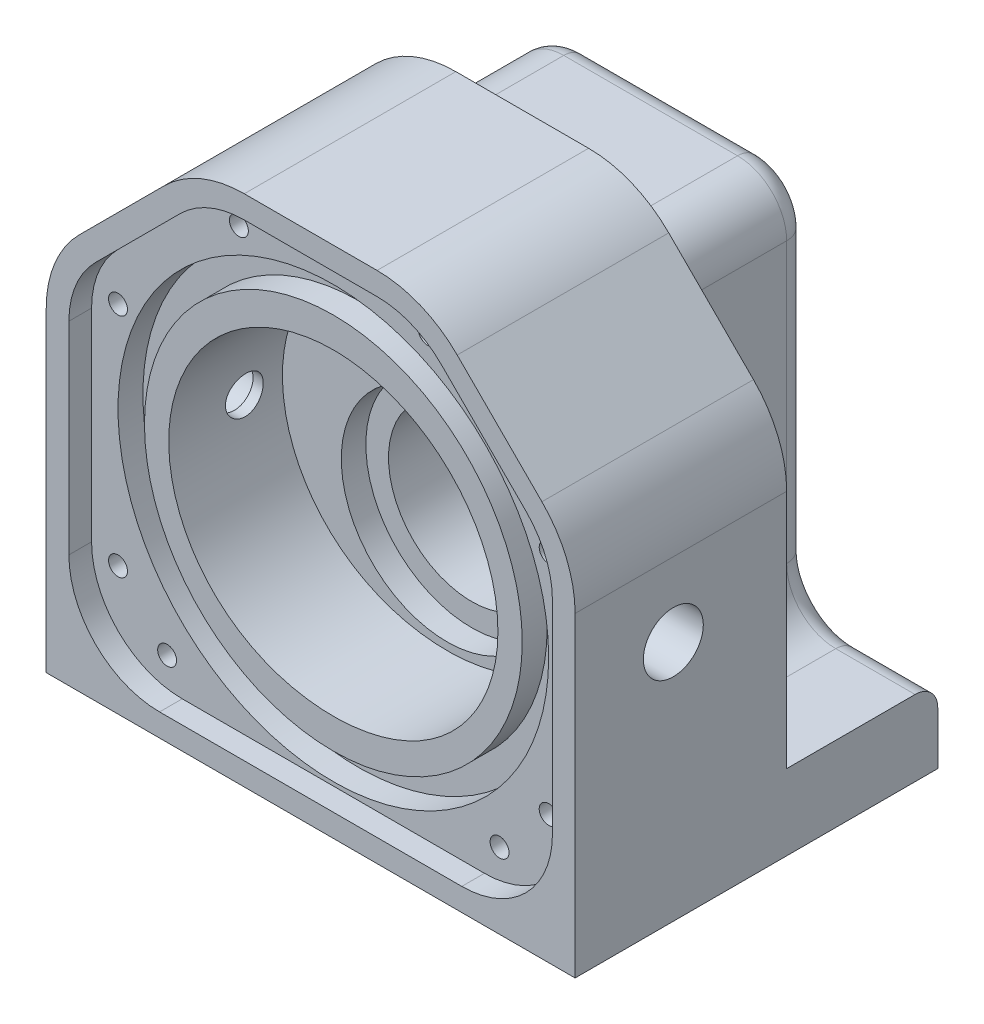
ISO-10303-21;
HEADER;
FILE_DESCRIPTION(('STEP AP214'),'2;1');
FILE_NAME('part.step','',(''),(''),'','','');
FILE_SCHEMA(('AUTOMOTIVE_DESIGN { 1 0 10303 214 1 1 1 1 }'));
ENDSEC;
DATA;
#1=APPLICATION_CONTEXT('core data for automotive mechanical design processes');
#2=APPLICATION_PROTOCOL_DEFINITION('international standard','automotive_design',2000,#1);
#3=PRODUCT_CONTEXT('',#1,'mechanical');
#4=PRODUCT('Part','Part','',(#3));
#5=PRODUCT_RELATED_PRODUCT_CATEGORY('part','',(#4));
#6=PRODUCT_DEFINITION_FORMATION('','',#4);
#7=PRODUCT_DEFINITION_CONTEXT('part definition',#1,'design');
#8=PRODUCT_DEFINITION('design','',#6,#7);
#9=PRODUCT_DEFINITION_SHAPE('','',#8);
#10=(LENGTH_UNIT() NAMED_UNIT(*) SI_UNIT(.MILLI.,.METRE.));
#11=(NAMED_UNIT(*) PLANE_ANGLE_UNIT() SI_UNIT($,.RADIAN.));
#12=(NAMED_UNIT(*) SI_UNIT($,.STERADIAN.) SOLID_ANGLE_UNIT());
#13=UNCERTAINTY_MEASURE_WITH_UNIT(LENGTH_MEASURE(1.E-05),#10,'distance_accuracy_value','');
#14=(GEOMETRIC_REPRESENTATION_CONTEXT(3) GLOBAL_UNCERTAINTY_ASSIGNED_CONTEXT((#13)) GLOBAL_UNIT_ASSIGNED_CONTEXT((#10,
#11,#12)) REPRESENTATION_CONTEXT('',''));
#15=CARTESIAN_POINT('',(0.,0.,0.));
#16=DIRECTION('',(0.,0.,1.));
#17=DIRECTION('',(1.,0.,0.));
#18=AXIS2_PLACEMENT_3D('',#15,#16,#17);
#19=CARTESIAN_POINT('',(-20.,-17.,46.));
#20=DIRECTION('',(0.,0.,-1.));
#21=DIRECTION('',(-1.,0.,0.));
#22=AXIS2_PLACEMENT_3D('',#19,#20,#21);
#23=PLANE('',#22);
#24=CARTESIAN_POINT('',(0.,21.,46.));
#25=CARTESIAN_POINT('',(-0.785165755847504,21.,46.));
#26=CARTESIAN_POINT('',(-2.35475202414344,20.9171277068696,46.));
#27=CARTESIAN_POINT('',(-4.67934997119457,20.5409856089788,46.));
#28=CARTESIAN_POINT('',(-6.94549433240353,19.9234442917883,46.));
#29=CARTESIAN_POINT('',(-9.12418388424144,19.0714404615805,46.));
#30=CARTESIAN_POINT('',(-11.1892413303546,17.998599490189,46.));
#31=CARTESIAN_POINT('',(-13.117607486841,16.7233447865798,46.));
#32=CARTESIAN_POINT('',(-14.8854274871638,15.261944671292,46.));
#33=CARTESIAN_POINT('',(-16.4776209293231,13.640226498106,46.));
#34=CARTESIAN_POINT('',(-17.8749928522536,11.8786393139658,46.));
#35=CARTESIAN_POINT('',(-19.0696584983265,10.0049683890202,46.));
#36=CARTESIAN_POINT('',(-20.050536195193,8.04347682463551,46.));
#37=CARTESIAN_POINT('',(-20.816236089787,6.02207413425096,46.));
#38=CARTESIAN_POINT('',(-21.3632349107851,3.96576823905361,46.));
#39=CARTESIAN_POINT('',(-21.6948485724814,1.90058348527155,46.));
#40=CARTESIAN_POINT('',(-21.8168695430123,-0.149265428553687,46.));
#41=CARTESIAN_POINT('',(-21.7404292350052,-2.16138267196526,46.));
#42=CARTESIAN_POINT('',(-21.4740518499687,-4.11558799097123,46.));
#43=CARTESIAN_POINT('',(-21.0327765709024,-5.99422626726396,46.));
#44=CARTESIAN_POINT('',(-20.4309093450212,-7.78124120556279,46.));
#45=CARTESIAN_POINT('',(-19.6865895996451,-9.46482454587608,46.));
#46=CARTESIAN_POINT('',(-18.8134720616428,-11.0335500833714,46.));
#47=CARTESIAN_POINT('',(-17.8344724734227,-12.4835531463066,46.));
#48=CARTESIAN_POINT('',(-16.7609679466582,-13.8071466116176,46.));
#49=CARTESIAN_POINT('',(-15.6141142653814,-15.0055030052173,46.));
#50=CARTESIAN_POINT('',(-14.4072097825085,-16.0777408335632,46.));
#51=CARTESIAN_POINT('',(-13.155060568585,-17.027334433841,46.));
#52=CARTESIAN_POINT('',(-11.8695618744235,-17.8575227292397,46.));
#53=CARTESIAN_POINT('',(-10.5625998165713,-18.5757479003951,46.));
#54=CARTESIAN_POINT('',(-9.24215829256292,-19.1858622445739,46.));
#55=CARTESIAN_POINT('',(-7.9164407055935,-19.6979043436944,46.));
#56=CARTESIAN_POINT('',(-6.58878735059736,-20.1148177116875,46.));
#57=CARTESIAN_POINT('',(-5.26363780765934,-20.4461077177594,46.));
#58=CARTESIAN_POINT('',(-3.94250480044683,-20.6970815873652,46.));
#59=CARTESIAN_POINT('',(-2.62545200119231,-20.8735151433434,46.));
#60=CARTESIAN_POINT('',(-1.31182475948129,-20.9775559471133,46.));
#61=CARTESIAN_POINT('',(0.,-21.0111935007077,46.));
#62=CARTESIAN_POINT('',(1.31182475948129,-20.9775559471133,46.));
#63=CARTESIAN_POINT('',(2.62545200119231,-20.8735151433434,46.));
#64=CARTESIAN_POINT('',(3.94250480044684,-20.6970815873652,46.));
#65=CARTESIAN_POINT('',(5.26363780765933,-20.4461077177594,46.));
#66=CARTESIAN_POINT('',(6.58878735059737,-20.1148177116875,46.));
#67=CARTESIAN_POINT('',(7.91644070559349,-19.6979043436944,46.));
#68=CARTESIAN_POINT('',(9.24215829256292,-19.1858622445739,46.));
#69=CARTESIAN_POINT('',(10.5625998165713,-18.5757479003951,46.));
#70=CARTESIAN_POINT('',(11.8695618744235,-17.8575227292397,46.));
#71=CARTESIAN_POINT('',(13.155060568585,-17.027334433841,46.));
#72=CARTESIAN_POINT('',(14.4072097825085,-16.0777408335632,46.));
#73=CARTESIAN_POINT('',(15.6141142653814,-15.0055030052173,46.));
#74=CARTESIAN_POINT('',(16.7609679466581,-13.8071466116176,46.));
#75=CARTESIAN_POINT('',(17.8344724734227,-12.4835531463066,46.));
#76=CARTESIAN_POINT('',(18.8134720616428,-11.0335500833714,46.));
#77=CARTESIAN_POINT('',(19.6865895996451,-9.46482454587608,46.));
#78=CARTESIAN_POINT('',(20.4309093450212,-7.78124120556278,46.));
#79=CARTESIAN_POINT('',(21.0327765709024,-5.99422626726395,46.));
#80=CARTESIAN_POINT('',(21.4740518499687,-4.11558799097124,46.));
#81=CARTESIAN_POINT('',(21.7404292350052,-2.16138267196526,46.));
#82=CARTESIAN_POINT('',(21.8168695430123,-0.149265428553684,46.));
#83=CARTESIAN_POINT('',(21.6948485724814,1.90058348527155,46.));
#84=CARTESIAN_POINT('',(21.3632349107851,3.96576823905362,46.));
#85=CARTESIAN_POINT('',(20.816236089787,6.02207413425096,46.));
#86=CARTESIAN_POINT('',(20.050536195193,8.04347682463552,46.));
#87=CARTESIAN_POINT('',(19.0696584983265,10.0049683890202,46.));
#88=CARTESIAN_POINT('',(17.8749928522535,11.8786393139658,46.));
#89=CARTESIAN_POINT('',(16.4776209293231,13.640226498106,46.));
#90=CARTESIAN_POINT('',(14.8854274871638,15.261944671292,46.));
#91=CARTESIAN_POINT('',(13.117607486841,16.7233447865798,46.));
#92=CARTESIAN_POINT('',(11.1892413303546,17.998599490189,46.));
#93=CARTESIAN_POINT('',(9.12418388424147,19.0714404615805,46.));
#94=CARTESIAN_POINT('',(6.94549433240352,19.9234442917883,46.));
#95=CARTESIAN_POINT('',(4.67934997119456,20.5409856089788,46.));
#96=CARTESIAN_POINT('',(2.35475202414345,20.9171277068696,46.));
#97=CARTESIAN_POINT('',(0.785165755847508,21.,46.));
#98=CARTESIAN_POINT('',(0.,21.,46.));
#99=B_SPLINE_CURVE_WITH_KNOTS('',3,(#24,#25,#26,#27,#28,#29,#30,#31,#32,#33,#34,#35,#36,#37,#38,
#39,#40,#41,#42,#43,#44,#45,#46,#47,#48,#49,#50,#51,#52,#53,#54,#55,#56,#57,#58,#59,#60,#61,#62,
#63,#64,#65,#66,#67,#68,#69,#70,#71,#72,#73,#74,#75,#76,#77,#78,#79,#80,#81,#82,#83,#84,#85,#86,
#87,#88,#89,#90,#91,#92,#93,#94,#95,#96,#97,#98),.UNSPECIFIED.,.T.,.F.,(4,1,1,1,1,1,1,1,1,1,1,1,
1,1,1,1,1,1,1,1,1,1,1,1,1,1,1,1,1,1,1,1,1,1,1,1,1,1,1,1,1,1,1,1,1,1,1,1,1,1,1,1,1,1,1,1,1,1,1,1,
1,1,1,1,1,1,1,1,1,1,1,1,4),(0.,0.0174904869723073,0.0349643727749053,0.0523829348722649,
0.0697409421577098,0.0870028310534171,0.104152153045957,0.121170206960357,0.138028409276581,
0.15471149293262,0.171192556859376,0.187465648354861,0.20350297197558,0.219285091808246,
0.23480734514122,0.250041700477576,0.264977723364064,0.279613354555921,0.293930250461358,
0.307922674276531,0.321579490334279,0.334898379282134,0.347883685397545,0.360523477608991,
0.372834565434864,0.384811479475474,0.396466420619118,0.407824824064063,0.418886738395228,
0.429676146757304,0.440219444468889,0.450538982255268,0.460670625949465,0.470645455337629,
0.480494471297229,0.49027202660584,0.5,0.509727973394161,0.519505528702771,0.529354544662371,
0.539329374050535,0.549461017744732,0.559780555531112,0.570323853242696,0.581113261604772,
0.592175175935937,0.603533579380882,0.615188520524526,0.627165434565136,0.639476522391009,
0.652116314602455,0.665101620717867,0.678420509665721,0.692077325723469,0.706069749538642,
0.720386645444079,0.735022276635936,0.749958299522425,0.76519265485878,0.780714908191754,
0.79649702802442,0.812534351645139,0.828807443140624,0.84528850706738,0.861971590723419,
0.878829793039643,0.895847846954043,0.912997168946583,0.93025905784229,0.947617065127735,
0.965035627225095,0.982509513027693,1.),.UNSPECIFIED.);
#100=CARTESIAN_POINT('',(0.,21.,46.));
#101=VERTEX_POINT('',#100);
#102=EDGE_CURVE('E395',#101,#101,#99,.T.);
#103=ORIENTED_EDGE('',*,*,#102,.F.);
#104=EDGE_LOOP('',(#103));
#105=FACE_BOUND('',#104,.T.);
#106=CARTESIAN_POINT('',(0.,0.,46.));
#107=DIRECTION('',(0.,0.,1.));
#108=DIRECTION('',(1.,0.,0.));
#109=AXIS2_PLACEMENT_3D('',#106,#107,#108);
#110=CIRCLE('',#109,25.);
#111=CARTESIAN_POINT('',(25.,0.,46.));
#112=VERTEX_POINT('',#111);
#113=EDGE_CURVE('E370',#112,#112,#110,.T.);
#114=ORIENTED_EDGE('',*,*,#113,.T.);
#115=EDGE_LOOP('',(#114));
#116=FACE_BOUND('',#115,.T.);
#117=ADVANCED_FACE('F43',(#105,#116),#23,.F.);
#118=CARTESIAN_POINT('',(0.,-6.,1.));
#119=DIRECTION('',(0.,0.,1.));
#120=DIRECTION('',(1.,0.,0.));
#121=AXIS2_PLACEMENT_3D('',#118,#119,#120);
#122=CYLINDRICAL_SURFACE('',#121,8.25);
#123=CARTESIAN_POINT('',(0.,-6.,1.));
#124=DIRECTION('',(0.,0.,1.));
#125=DIRECTION('',(1.,0.,0.));
#126=AXIS2_PLACEMENT_3D('',#123,#124,#125);
#127=CIRCLE('',#126,8.25);
#128=CARTESIAN_POINT('',(8.25,-6.,1.));
#129=VERTEX_POINT('',#128);
#130=EDGE_CURVE('E620',#129,#129,#127,.T.);
#131=ORIENTED_EDGE('',*,*,#130,.F.);
#132=EDGE_LOOP('',(#131));
#133=FACE_BOUND('',#132,.T.);
#134=CARTESIAN_POINT('',(0.,-6.,4.69999999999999));
#135=DIRECTION('',(0.,0.,1.));
#136=DIRECTION('',(1.,0.,0.));
#137=AXIS2_PLACEMENT_3D('',#134,#135,#136);
#138=CIRCLE('',#137,8.25);
#139=CARTESIAN_POINT('',(8.25,-6.,4.69999999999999));
#140=VERTEX_POINT('',#139);
#141=EDGE_CURVE('E388',#140,#140,#138,.F.);
#142=ORIENTED_EDGE('',*,*,#141,.F.);
#143=EDGE_LOOP('',(#142));
#144=FACE_BOUND('',#143,.T.);
#145=ADVANCED_FACE('F532',(#133,#144),#122,.F.);
#146=CARTESIAN_POINT('',(-35.,-32.,50.));
#147=DIRECTION('',(1.,0.,0.));
#148=DIRECTION('',(0.,0.,-1.));
#149=AXIS2_PLACEMENT_3D('',#146,#147,#148);
#150=PLANE('',#149);
#151=CARTESIAN_POINT('',(-35.,0.,36.));
#152=DIRECTION('',(-1.,0.,0.));
#153=DIRECTION('',(0.,0.,1.));
#154=AXIS2_PLACEMENT_3D('',#151,#152,#153);
#155=CIRCLE('',#154,3.96875);
#156=CARTESIAN_POINT('',(-35.,0.,39.96875));
#157=VERTEX_POINT('',#156);
#158=EDGE_CURVE('E326',#157,#157,#155,.T.);
#159=ORIENTED_EDGE('',*,*,#158,.F.);
#160=EDGE_LOOP('',(#159));
#161=FACE_BOUND('',#160,.T.);
#162=DIRECTION('',(0.,0.,-1.));
#163=VECTOR('',#162,1.);
#164=CARTESIAN_POINT('',(-35.,-22.,21.));
#165=LINE('',#164,#163);
#166=CARTESIAN_POINT('',(-35.,-22.,21.));
#167=VERTEX_POINT('',#166);
#168=CARTESIAN_POINT('',(-35.,-22.,4.));
#169=VERTEX_POINT('',#168);
#170=EDGE_CURVE('E759',#167,#169,#165,.T.);
#171=ORIENTED_EDGE('',*,*,#170,.T.);
#172=CARTESIAN_POINT('',(-35.,-25.,4.));
#173=DIRECTION('',(1.,0.,0.));
#174=DIRECTION('',(0.,0.,-1.));
#175=AXIS2_PLACEMENT_3D('',#172,#173,#174);
#176=CIRCLE('',#175,3.);
#177=CARTESIAN_POINT('',(-35.,-25.,1.));
#178=VERTEX_POINT('',#177);
#179=EDGE_CURVE('E13',#169,#178,#176,.F.);
#180=ORIENTED_EDGE('',*,*,#179,.T.);
#181=DIRECTION('',(0.,1.,0.));
#182=VECTOR('',#181,1.);
#183=CARTESIAN_POINT('',(-35.,-32.,1.));
#184=LINE('',#183,#182);
#185=CARTESIAN_POINT('',(-35.,-32.,1.));
#186=VERTEX_POINT('',#185);
#187=EDGE_CURVE('E795',#186,#178,#184,.T.);
#188=ORIENTED_EDGE('',*,*,#187,.F.);
#189=DIRECTION('',(0.,0.,-1.));
#190=VECTOR('',#189,1.);
#191=CARTESIAN_POINT('',(-35.,-32.,50.));
#192=LINE('',#191,#190);
#193=CARTESIAN_POINT('',(-35.,-32.,49.));
#194=VERTEX_POINT('',#193);
#195=EDGE_CURVE('E803',#194,#186,#192,.T.);
#196=ORIENTED_EDGE('',*,*,#195,.F.);
#197=DIRECTION('',(0.,-1.,0.));
#198=VECTOR('',#197,1.);
#199=CARTESIAN_POINT('',(-35.,38.,49.));
#200=LINE('',#199,#198);
#201=CARTESIAN_POINT('',(-35.,9.78679656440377,49.));
#202=VERTEX_POINT('',#201);
#203=EDGE_CURVE('E701',#202,#194,#200,.T.);
#204=ORIENTED_EDGE('',*,*,#203,.F.);
#205=DIRECTION('',(0.,0.,1.));
#206=VECTOR('',#205,1.);
#207=CARTESIAN_POINT('',(-35.,9.78679656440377,19.));
#208=LINE('',#207,#206);
#209=CARTESIAN_POINT('',(-35.,9.78679656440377,21.));
#210=VERTEX_POINT('',#209);
#211=EDGE_CURVE('E672',#210,#202,#208,.T.);
#212=ORIENTED_EDGE('',*,*,#211,.F.);
#213=DIRECTION('',(0.,1.,0.));
#214=VECTOR('',#213,1.);
#215=CARTESIAN_POINT('',(-35.,-32.,21.));
#216=LINE('',#215,#214);
#217=EDGE_CURVE('E789',#167,#210,#216,.T.);
#218=ORIENTED_EDGE('',*,*,#217,.F.);
#219=EDGE_LOOP('',(#171,#180,#188,#196,#204,#212,#218));
#220=FACE_BOUND('',#219,.T.);
#221=ADVANCED_FACE('F45',(#161,#220),#150,.F.);
#222=CARTESIAN_POINT('',(0.,0.,21.));
#223=DIRECTION('',(0.,0.,-1.));
#224=DIRECTION('',(-1.,0.,0.));
#225=AXIS2_PLACEMENT_3D('',#222,#223,#224);
#226=PLANE('',#225);
#227=DIRECTION('',(0.707106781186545,-0.70710678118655,0.));
#228=VECTOR('',#227,1.);
#229=CARTESIAN_POINT('',(25.5000000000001,25.4999999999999,21.));
#230=LINE('',#229,#228);
#231=CARTESIAN_POINT('',(19.3933982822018,31.6066017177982,21.));
#232=VERTEX_POINT('',#231);
#233=CARTESIAN_POINT('',(30.6066017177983,20.3933982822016,21.));
#234=VERTEX_POINT('',#233);
#235=EDGE_CURVE('E695',#232,#234,#230,.T.);
#236=ORIENTED_EDGE('',*,*,#235,.T.);
#237=CARTESIAN_POINT('',(20.,9.78679656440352,21.));
#238=DIRECTION('',(0.,0.,-1.));
#239=DIRECTION('',(-1.,0.,0.));
#240=AXIS2_PLACEMENT_3D('',#237,#238,#239);
#241=CIRCLE('',#240,15.);
#242=CARTESIAN_POINT('',(35.,9.78679656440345,21.));
#243=VERTEX_POINT('',#242);
#244=EDGE_CURVE('E692',#234,#243,#241,.T.);
#245=ORIENTED_EDGE('',*,*,#244,.T.);
#246=DIRECTION('',(0.,-1.,0.));
#247=VECTOR('',#246,1.);
#248=CARTESIAN_POINT('',(35.,-32.,21.));
#249=LINE('',#248,#247);
#250=CARTESIAN_POINT('',(35.,-22.,21.));
#251=VERTEX_POINT('',#250);
#252=EDGE_CURVE('E762',#243,#251,#249,.T.);
#253=ORIENTED_EDGE('',*,*,#252,.T.);
#254=DIRECTION('',(1.,0.,0.));
#255=VECTOR('',#254,1.);
#256=CARTESIAN_POINT('',(35.,-22.,21.));
#257=LINE('',#256,#255);
#258=CARTESIAN_POINT('',(24.5,-22.,21.));
#259=VERTEX_POINT('',#258);
#260=EDGE_CURVE('E756',#259,#251,#257,.T.);
#261=ORIENTED_EDGE('',*,*,#260,.F.);
#262=CARTESIAN_POINT('',(24.5,-15.5,21.));
#263=DIRECTION('',(0.,0.,1.));
#264=DIRECTION('',(-1.,0.,0.));
#265=AXIS2_PLACEMENT_3D('',#262,#263,#264);
#266=CIRCLE('',#265,6.5);
#267=CARTESIAN_POINT('',(18.,-15.5,21.));
#268=VERTEX_POINT('',#267);
#269=EDGE_CURVE('E753',#268,#259,#266,.T.);
#270=ORIENTED_EDGE('',*,*,#269,.F.);
#271=DIRECTION('',(0.,-1.,0.));
#272=VECTOR('',#271,1.);
#273=CARTESIAN_POINT('',(18.,-15.5,21.));
#274=LINE('',#273,#272);
#275=CARTESIAN_POINT('',(18.,21.5,21.));
#276=VERTEX_POINT('',#275);
#277=EDGE_CURVE('E750',#276,#268,#274,.T.);
#278=ORIENTED_EDGE('',*,*,#277,.F.);
#279=CARTESIAN_POINT('',(11.5,21.5,21.));
#280=DIRECTION('',(0.,0.,-1.));
#281=DIRECTION('',(1.,0.,0.));
#282=AXIS2_PLACEMENT_3D('',#279,#280,#281);
#283=CIRCLE('',#282,6.5);
#284=CARTESIAN_POINT('',(11.5,28.,21.));
#285=VERTEX_POINT('',#284);
#286=EDGE_CURVE('E747',#285,#276,#283,.T.);
#287=ORIENTED_EDGE('',*,*,#286,.F.);
#288=DIRECTION('',(1.,0.,0.));
#289=VECTOR('',#288,1.);
#290=CARTESIAN_POINT('',(11.5,28.,21.));
#291=LINE('',#290,#289);
#292=CARTESIAN_POINT('',(-11.5,28.,21.));
#293=VERTEX_POINT('',#292);
#294=EDGE_CURVE('E744',#293,#285,#291,.T.);
#295=ORIENTED_EDGE('',*,*,#294,.F.);
#296=CARTESIAN_POINT('',(-11.5,21.5,21.));
#297=DIRECTION('',(0.,0.,-1.));
#298=DIRECTION('',(-1.,0.,0.));
#299=AXIS2_PLACEMENT_3D('',#296,#297,#298);
#300=CIRCLE('',#299,6.5);
#301=CARTESIAN_POINT('',(-18.,21.5,21.));
#302=VERTEX_POINT('',#301);
#303=EDGE_CURVE('E741',#302,#293,#300,.T.);
#304=ORIENTED_EDGE('',*,*,#303,.F.);
#305=DIRECTION('',(0.,1.,0.));
#306=VECTOR('',#305,1.);
#307=CARTESIAN_POINT('',(-18.,21.5,21.));
#308=LINE('',#307,#306);
#309=CARTESIAN_POINT('',(-18.,-15.5,21.));
#310=VERTEX_POINT('',#309);
#311=EDGE_CURVE('E738',#310,#302,#308,.T.);
#312=ORIENTED_EDGE('',*,*,#311,.F.);
#313=CARTESIAN_POINT('',(-24.5,-15.5,21.));
#314=DIRECTION('',(0.,0.,1.));
#315=DIRECTION('',(-1.,0.,0.));
#316=AXIS2_PLACEMENT_3D('',#313,#314,#315);
#317=CIRCLE('',#316,6.5);
#318=CARTESIAN_POINT('',(-24.5,-22.,21.));
#319=VERTEX_POINT('',#318);
#320=EDGE_CURVE('E735',#319,#310,#317,.T.);
#321=ORIENTED_EDGE('',*,*,#320,.F.);
#322=DIRECTION('',(1.,0.,0.));
#323=VECTOR('',#322,1.);
#324=CARTESIAN_POINT('',(-24.5,-22.,21.));
#325=LINE('',#324,#323);
#326=EDGE_CURVE('E732',#167,#319,#325,.T.);
#327=ORIENTED_EDGE('',*,*,#326,.F.);
#328=ORIENTED_EDGE('',*,*,#217,.T.);
#329=CARTESIAN_POINT('',(-20.,9.78679656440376,21.));
#330=DIRECTION('',(0.,0.,-1.));
#331=DIRECTION('',(-1.,0.,0.));
#332=AXIS2_PLACEMENT_3D('',#329,#330,#331);
#333=CIRCLE('',#332,15.);
#334=CARTESIAN_POINT('',(-30.6066017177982,20.393398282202,21.));
#335=VERTEX_POINT('',#334);
#336=EDGE_CURVE('E689',#210,#335,#333,.T.);
#337=ORIENTED_EDGE('',*,*,#336,.T.);
#338=DIRECTION('',(0.707106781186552,0.707106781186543,0.));
#339=VECTOR('',#338,1.);
#340=CARTESIAN_POINT('',(-25.4999999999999,25.5000000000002,21.));
#341=LINE('',#340,#339);
#342=CARTESIAN_POINT('',(-19.3933982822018,31.6066017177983,21.));
#343=VERTEX_POINT('',#342);
#344=EDGE_CURVE('E686',#335,#343,#341,.T.);
#345=ORIENTED_EDGE('',*,*,#344,.T.);
#346=CARTESIAN_POINT('',(-8.78679656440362,21.,21.));
#347=DIRECTION('',(0.,0.,-1.));
#348=DIRECTION('',(-1.,0.,0.));
#349=AXIS2_PLACEMENT_3D('',#346,#347,#348);
#350=CIRCLE('',#349,15.);
#351=CARTESIAN_POINT('',(-8.78679656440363,36.,21.));
#352=VERTEX_POINT('',#351);
#353=EDGE_CURVE('E683',#343,#352,#350,.T.);
#354=ORIENTED_EDGE('',*,*,#353,.T.);
#355=DIRECTION('',(1.,0.,0.));
#356=VECTOR('',#355,1.);
#357=CARTESIAN_POINT('',(0.,36.,21.));
#358=LINE('',#357,#356);
#359=CARTESIAN_POINT('',(8.78679656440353,36.,21.));
#360=VERTEX_POINT('',#359);
#361=EDGE_CURVE('E666',#352,#360,#358,.T.);
#362=ORIENTED_EDGE('',*,*,#361,.T.);
#363=CARTESIAN_POINT('',(8.78679656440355,21.,21.));
#364=DIRECTION('',(0.,0.,-1.));
#365=DIRECTION('',(-1.,0.,0.));
#366=AXIS2_PLACEMENT_3D('',#363,#364,#365);
#367=CIRCLE('',#366,15.);
#368=EDGE_CURVE('E698',#360,#232,#367,.T.);
#369=ORIENTED_EDGE('',*,*,#368,.T.);
#370=EDGE_LOOP('',(#236,#245,#253,#261,#270,#278,#287,#295,#304,#312,#321,#327,#328,#337,#345,
#354,#362,#369));
#371=FACE_BOUND('',#370,.T.);
#372=ADVANCED_FACE('F880',(#371),#226,.T.);
#373=CARTESIAN_POINT('',(-35.,-32.,49.));
#374=DIRECTION('',(0.,0.,-1.));
#375=DIRECTION('',(-1.,0.,0.));
#376=AXIS2_PLACEMENT_3D('',#373,#374,#375);
#377=PLANE('',#376);
#378=DIRECTION('',(1.,0.,0.));
#379=VECTOR('',#378,1.);
#380=CARTESIAN_POINT('',(-19.9999999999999,-29.,49.));
#381=LINE('',#380,#379);
#382=CARTESIAN_POINT('',(-19.9999999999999,-29.,49.));
#383=VERTEX_POINT('',#382);
#384=CARTESIAN_POINT('',(19.9999999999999,-29.,49.));
#385=VERTEX_POINT('',#384);
#386=EDGE_CURVE('E1576',#383,#385,#381,.T.);
#387=ORIENTED_EDGE('',*,*,#386,.F.);
#388=CARTESIAN_POINT('',(-20.,-17.,49.));
#389=DIRECTION('',(0.,0.,1.));
#390=DIRECTION('',(-1.,0.,0.));
#391=AXIS2_PLACEMENT_3D('',#388,#389,#390);
#392=CIRCLE('',#391,12.);
#393=CARTESIAN_POINT('',(-32.,-16.9999999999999,49.));
#394=VERTEX_POINT('',#393);
#395=EDGE_CURVE('E60',#394,#383,#392,.T.);
#396=ORIENTED_EDGE('',*,*,#395,.F.);
#397=DIRECTION('',(0.,-1.,0.));
#398=VECTOR('',#397,1.);
#399=CARTESIAN_POINT('',(-32.,9.78679656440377,49.));
#400=LINE('',#399,#398);
#401=CARTESIAN_POINT('',(-32.,9.78679656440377,49.));
#402=VERTEX_POINT('',#401);
#403=EDGE_CURVE('E583',#402,#394,#400,.T.);
#404=ORIENTED_EDGE('',*,*,#403,.F.);
#405=CARTESIAN_POINT('',(-20.,9.78679656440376,49.));
#406=DIRECTION('',(0.,0.,1.));
#407=DIRECTION('',(1.,0.,0.));
#408=AXIS2_PLACEMENT_3D('',#405,#406,#407);
#409=CIRCLE('',#408,12.);
#410=CARTESIAN_POINT('',(-28.4852813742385,18.2720779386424,49.));
#411=VERTEX_POINT('',#410);
#412=EDGE_CURVE('E588',#411,#402,#409,.T.);
#413=ORIENTED_EDGE('',*,*,#412,.F.);
#414=DIRECTION('',(-0.707106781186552,-0.707106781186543,0.));
#415=VECTOR('',#414,1.);
#416=CARTESIAN_POINT('',(-17.2720779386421,29.4852813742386,49.));
#417=LINE('',#416,#415);
#418=CARTESIAN_POINT('',(-17.2720779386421,29.4852813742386,49.));
#419=VERTEX_POINT('',#418);
#420=EDGE_CURVE('E1601',#419,#411,#417,.T.);
#421=ORIENTED_EDGE('',*,*,#420,.F.);
#422=CARTESIAN_POINT('',(-8.78679656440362,21.,49.));
#423=DIRECTION('',(0.,0.,1.));
#424=DIRECTION('',(1.,0.,0.));
#425=AXIS2_PLACEMENT_3D('',#422,#423,#424);
#426=CIRCLE('',#425,12.);
#427=CARTESIAN_POINT('',(-8.78679656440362,33.,49.));
#428=VERTEX_POINT('',#427);
#429=EDGE_CURVE('E1598',#428,#419,#426,.T.);
#430=ORIENTED_EDGE('',*,*,#429,.F.);
#431=DIRECTION('',(-1.,0.,0.));
#432=VECTOR('',#431,1.);
#433=CARTESIAN_POINT('',(8.78679656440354,33.,49.));
#434=LINE('',#433,#432);
#435=CARTESIAN_POINT('',(8.78679656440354,33.,49.));
#436=VERTEX_POINT('',#435);
#437=EDGE_CURVE('E1595',#436,#428,#434,.T.);
#438=ORIENTED_EDGE('',*,*,#437,.F.);
#439=CARTESIAN_POINT('',(8.78679656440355,21.,49.));
#440=DIRECTION('',(0.,0.,1.));
#441=DIRECTION('',(1.,0.,0.));
#442=AXIS2_PLACEMENT_3D('',#439,#440,#441);
#443=CIRCLE('',#442,12.);
#444=CARTESIAN_POINT('',(17.2720779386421,29.4852813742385,49.));
#445=VERTEX_POINT('',#444);
#446=EDGE_CURVE('E1592',#445,#436,#443,.T.);
#447=ORIENTED_EDGE('',*,*,#446,.F.);
#448=DIRECTION('',(-0.707106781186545,0.70710678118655,0.));
#449=VECTOR('',#448,1.);
#450=CARTESIAN_POINT('',(28.4852813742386,18.272077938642,49.));
#451=LINE('',#450,#449);
#452=CARTESIAN_POINT('',(28.4852813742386,18.272077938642,49.));
#453=VERTEX_POINT('',#452);
#454=EDGE_CURVE('E1589',#453,#445,#451,.T.);
#455=ORIENTED_EDGE('',*,*,#454,.F.);
#456=CARTESIAN_POINT('',(20.,9.78679656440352,49.));
#457=DIRECTION('',(0.,0.,1.));
#458=DIRECTION('',(1.,0.,0.));
#459=AXIS2_PLACEMENT_3D('',#456,#457,#458);
#460=CIRCLE('',#459,12.);
#461=CARTESIAN_POINT('',(32.,9.78679656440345,49.));
#462=VERTEX_POINT('',#461);
#463=EDGE_CURVE('E1586',#462,#453,#460,.T.);
#464=ORIENTED_EDGE('',*,*,#463,.F.);
#465=DIRECTION('',(0.,1.,0.));
#466=VECTOR('',#465,1.);
#467=CARTESIAN_POINT('',(32.,-16.9999999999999,49.));
#468=LINE('',#467,#466);
#469=CARTESIAN_POINT('',(32.,-16.9999999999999,49.));
#470=VERTEX_POINT('',#469);
#471=EDGE_CURVE('E1581',#470,#462,#468,.T.);
#472=ORIENTED_EDGE('',*,*,#471,.F.);
#473=CARTESIAN_POINT('',(20.,-17.,49.));
#474=DIRECTION('',(0.,0.,1.));
#475=DIRECTION('',(-1.,0.,0.));
#476=AXIS2_PLACEMENT_3D('',#473,#474,#475);
#477=CIRCLE('',#476,12.);
#478=EDGE_CURVE('E1580',#385,#470,#477,.T.);
#479=ORIENTED_EDGE('',*,*,#478,.F.);
#480=EDGE_LOOP('',(#387,#396,#404,#413,#421,#430,#438,#447,#455,#464,#472,#479));
#481=FACE_BOUND('',#480,.T.);
#482=CARTESIAN_POINT('',(20.,9.78679656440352,49.));
#483=DIRECTION('',(0.,0.,1.));
#484=DIRECTION('',(-1.,0.,0.));
#485=AXIS2_PLACEMENT_3D('',#482,#483,#484);
#486=CIRCLE('',#485,15.);
#487=CARTESIAN_POINT('',(35.,9.78679656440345,49.));
#488=VERTEX_POINT('',#487);
#489=CARTESIAN_POINT('',(30.6066017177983,20.3933982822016,49.));
#490=VERTEX_POINT('',#489);
#491=EDGE_CURVE('E657',#488,#490,#486,.T.);
#492=ORIENTED_EDGE('',*,*,#491,.T.);
#493=DIRECTION('',(-0.707106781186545,0.70710678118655,0.));
#494=VECTOR('',#493,1.);
#495=CARTESIAN_POINT('',(19.3933982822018,31.6066017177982,49.));
#496=LINE('',#495,#494);
#497=CARTESIAN_POINT('',(19.3933982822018,31.6066017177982,49.));
#498=VERTEX_POINT('',#497);
#499=EDGE_CURVE('E660',#490,#498,#496,.T.);
#500=ORIENTED_EDGE('',*,*,#499,.T.);
#501=CARTESIAN_POINT('',(8.78679656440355,21.,49.));
#502=DIRECTION('',(0.,0.,1.));
#503=DIRECTION('',(1.,0.,0.));
#504=AXIS2_PLACEMENT_3D('',#501,#502,#503);
#505=CIRCLE('',#504,15.);
#506=CARTESIAN_POINT('',(8.78679656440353,36.,49.));
#507=VERTEX_POINT('',#506);
#508=EDGE_CURVE('E644',#498,#507,#505,.T.);
#509=ORIENTED_EDGE('',*,*,#508,.T.);
#510=DIRECTION('',(-1.,0.,0.));
#511=VECTOR('',#510,1.);
#512=CARTESIAN_POINT('',(-8.78679656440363,36.,49.));
#513=LINE('',#512,#511);
#514=CARTESIAN_POINT('',(-8.78679656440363,36.,49.));
#515=VERTEX_POINT('',#514);
#516=EDGE_CURVE('E647',#507,#515,#513,.T.);
#517=ORIENTED_EDGE('',*,*,#516,.T.);
#518=CARTESIAN_POINT('',(-8.78679656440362,21.,49.));
#519=DIRECTION('',(0.,0.,1.));
#520=DIRECTION('',(-1.,0.,0.));
#521=AXIS2_PLACEMENT_3D('',#518,#519,#520);
#522=CIRCLE('',#521,15.);
#523=CARTESIAN_POINT('',(-19.3933982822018,31.6066017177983,49.));
#524=VERTEX_POINT('',#523);
#525=EDGE_CURVE('E68',#515,#524,#522,.T.);
#526=ORIENTED_EDGE('',*,*,#525,.T.);
#527=DIRECTION('',(-0.707106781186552,-0.707106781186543,0.));
#528=VECTOR('',#527,1.);
#529=CARTESIAN_POINT('',(-19.3933982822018,31.6066017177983,49.));
#530=LINE('',#529,#528);
#531=CARTESIAN_POINT('',(-30.6066017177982,20.393398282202,49.));
#532=VERTEX_POINT('',#531);
#533=EDGE_CURVE('E651',#524,#532,#530,.T.);
#534=ORIENTED_EDGE('',*,*,#533,.T.);
#535=CARTESIAN_POINT('',(-20.,9.78679656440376,49.));
#536=DIRECTION('',(0.,0.,1.));
#537=DIRECTION('',(1.,0.,0.));
#538=AXIS2_PLACEMENT_3D('',#535,#536,#537);
#539=CIRCLE('',#538,15.);
#540=EDGE_CURVE('E654',#532,#202,#539,.T.);
#541=ORIENTED_EDGE('',*,*,#540,.T.);
#542=ORIENTED_EDGE('',*,*,#203,.T.);
#543=DIRECTION('',(1.,0.,0.));
#544=VECTOR('',#543,1.);
#545=CARTESIAN_POINT('',(-35.,-32.,49.));
#546=LINE('',#545,#544);
#547=CARTESIAN_POINT('',(35.,-32.,49.));
#548=VERTEX_POINT('',#547);
#549=EDGE_CURVE('E703',#194,#548,#546,.T.);
#550=ORIENTED_EDGE('',*,*,#549,.T.);
#551=DIRECTION('',(0.,1.,0.));
#552=VECTOR('',#551,1.);
#553=CARTESIAN_POINT('',(35.,-32.,49.));
#554=LINE('',#553,#552);
#555=EDGE_CURVE('E704',#548,#488,#554,.T.);
#556=ORIENTED_EDGE('',*,*,#555,.T.);
#557=EDGE_LOOP('',(#492,#500,#509,#517,#526,#534,#541,#542,#550,#556));
#558=FACE_BOUND('',#557,.T.);
#559=ADVANCED_FACE('F872',(#481,#558),#377,.F.);
#560=CARTESIAN_POINT('',(-35.,-32.,1.));
#561=DIRECTION('',(0.,0.,-1.));
#562=DIRECTION('',(-1.,0.,0.));
#563=AXIS2_PLACEMENT_3D('',#560,#561,#562);
#564=PLANE('',#563);
#565=ORIENTED_EDGE('',*,*,#130,.T.);
#566=EDGE_LOOP('',(#565));
#567=FACE_BOUND('',#566,.T.);
#568=CARTESIAN_POINT('',(24.5,-15.5,1.));
#569=DIRECTION('',(0.,0.,-1.));
#570=DIRECTION('',(-1.,0.,0.));
#571=AXIS2_PLACEMENT_3D('',#568,#569,#570);
#572=CIRCLE('',#571,9.5);
#573=CARTESIAN_POINT('',(15.,-15.4999999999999,1.));
#574=VERTEX_POINT('',#573);
#575=CARTESIAN_POINT('',(24.5,-25.,1.));
#576=VERTEX_POINT('',#575);
#577=EDGE_CURVE('E819',#574,#576,#572,.F.);
#578=ORIENTED_EDGE('',*,*,#577,.T.);
#579=DIRECTION('',(1.,0.,0.));
#580=VECTOR('',#579,1.);
#581=CARTESIAN_POINT('',(-35.,-25.,1.));
#582=LINE('',#581,#580);
#583=CARTESIAN_POINT('',(35.,-25.,1.));
#584=VERTEX_POINT('',#583);
#585=EDGE_CURVE('E821',#576,#584,#582,.T.);
#586=ORIENTED_EDGE('',*,*,#585,.T.);
#587=DIRECTION('',(0.,-1.,0.));
#588=VECTOR('',#587,1.);
#589=CARTESIAN_POINT('',(35.,38.,1.));
#590=LINE('',#589,#588);
#591=CARTESIAN_POINT('',(35.,-32.,1.));
#592=VERTEX_POINT('',#591);
#593=EDGE_CURVE('E798',#584,#592,#590,.T.);
#594=ORIENTED_EDGE('',*,*,#593,.T.);
#595=DIRECTION('',(-1.,0.,0.));
#596=VECTOR('',#595,1.);
#597=CARTESIAN_POINT('',(35.,-32.,1.));
#598=LINE('',#597,#596);
#599=EDGE_CURVE('E792',#592,#186,#598,.T.);
#600=ORIENTED_EDGE('',*,*,#599,.T.);
#601=ORIENTED_EDGE('',*,*,#187,.T.);
#602=DIRECTION('',(1.,0.,0.));
#603=VECTOR('',#602,1.);
#604=CARTESIAN_POINT('',(-35.,-25.,1.));
#605=LINE('',#604,#603);
#606=CARTESIAN_POINT('',(-24.5000000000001,-25.,1.));
#607=VERTEX_POINT('',#606);
#608=EDGE_CURVE('E805',#178,#607,#605,.T.);
#609=ORIENTED_EDGE('',*,*,#608,.T.);
#610=CARTESIAN_POINT('',(-24.5,-15.5,1.));
#611=DIRECTION('',(0.,0.,-1.));
#612=DIRECTION('',(-1.,0.,0.));
#613=AXIS2_PLACEMENT_3D('',#610,#611,#612);
#614=CIRCLE('',#613,9.5);
#615=CARTESIAN_POINT('',(-15.,-15.5,1.));
#616=VERTEX_POINT('',#615);
#617=EDGE_CURVE('E807',#607,#616,#614,.F.);
#618=ORIENTED_EDGE('',*,*,#617,.T.);
#619=DIRECTION('',(0.,1.,0.));
#620=VECTOR('',#619,1.);
#621=CARTESIAN_POINT('',(-15.,-32.,1.));
#622=LINE('',#621,#620);
#623=CARTESIAN_POINT('',(-15.,21.5,1.));
#624=VERTEX_POINT('',#623);
#625=EDGE_CURVE('E809',#616,#624,#622,.T.);
#626=ORIENTED_EDGE('',*,*,#625,.T.);
#627=CARTESIAN_POINT('',(-11.5,21.5,1.));
#628=DIRECTION('',(0.,0.,-1.));
#629=DIRECTION('',(-1.,0.,0.));
#630=AXIS2_PLACEMENT_3D('',#627,#628,#629);
#631=CIRCLE('',#630,3.5);
#632=CARTESIAN_POINT('',(-11.5,25.,1.));
#633=VERTEX_POINT('',#632);
#634=EDGE_CURVE('E811',#624,#633,#631,.T.);
#635=ORIENTED_EDGE('',*,*,#634,.T.);
#636=DIRECTION('',(1.,0.,0.));
#637=VECTOR('',#636,1.);
#638=CARTESIAN_POINT('',(-35.,25.,1.));
#639=LINE('',#638,#637);
#640=CARTESIAN_POINT('',(11.5,25.,1.));
#641=VERTEX_POINT('',#640);
#642=EDGE_CURVE('E813',#633,#641,#639,.T.);
#643=ORIENTED_EDGE('',*,*,#642,.T.);
#644=CARTESIAN_POINT('',(11.5,21.5,1.));
#645=DIRECTION('',(0.,0.,-1.));
#646=DIRECTION('',(-1.,0.,0.));
#647=AXIS2_PLACEMENT_3D('',#644,#645,#646);
#648=CIRCLE('',#647,3.5);
#649=CARTESIAN_POINT('',(15.,21.5,1.));
#650=VERTEX_POINT('',#649);
#651=EDGE_CURVE('E815',#641,#650,#648,.T.);
#652=ORIENTED_EDGE('',*,*,#651,.T.);
#653=DIRECTION('',(0.,-1.,0.));
#654=VECTOR('',#653,1.);
#655=CARTESIAN_POINT('',(15.,-32.,1.));
#656=LINE('',#655,#654);
#657=EDGE_CURVE('E817',#650,#574,#656,.T.);
#658=ORIENTED_EDGE('',*,*,#657,.T.);
#659=EDGE_LOOP('',(#578,#586,#594,#600,#601,#609,#618,#626,#635,#643,#652,#658));
#660=FACE_BOUND('',#659,.T.);
#661=ADVANCED_FACE('F862',(#567,#660),#564,.T.);
#662=CARTESIAN_POINT('',(-35.,-32.,50.));
#663=DIRECTION('',(0.,1.,0.));
#664=DIRECTION('',(0.,0.,1.));
#665=AXIS2_PLACEMENT_3D('',#662,#663,#664);
#666=PLANE('',#665);
#667=ORIENTED_EDGE('',*,*,#195,.T.);
#668=ORIENTED_EDGE('',*,*,#599,.F.);
#669=DIRECTION('',(0.,0.,-1.));
#670=VECTOR('',#669,1.);
#671=CARTESIAN_POINT('',(35.,-32.,50.));
#672=LINE('',#671,#670);
#673=EDGE_CURVE('E801',#548,#592,#672,.T.);
#674=ORIENTED_EDGE('',*,*,#673,.F.);
#675=ORIENTED_EDGE('',*,*,#549,.F.);
#676=EDGE_LOOP('',(#667,#668,#674,#675));
#677=FACE_BOUND('',#676,.T.);
#678=ADVANCED_FACE('F867',(#677),#666,.F.);
#679=CARTESIAN_POINT('',(35.,-32.,50.));
#680=DIRECTION('',(-1.,0.,0.));
#681=DIRECTION('',(0.,0.,1.));
#682=AXIS2_PLACEMENT_3D('',#679,#680,#681);
#683=PLANE('',#682);
#684=CARTESIAN_POINT('',(35.,0.,36.));
#685=DIRECTION('',(1.,0.,0.));
#686=DIRECTION('',(0.,0.,-1.));
#687=AXIS2_PLACEMENT_3D('',#684,#685,#686);
#688=CIRCLE('',#687,3.96875);
#689=CARTESIAN_POINT('',(35.,0.,32.03125));
#690=VERTEX_POINT('',#689);
#691=EDGE_CURVE('E1510',#690,#690,#688,.T.);
#692=ORIENTED_EDGE('',*,*,#691,.F.);
#693=EDGE_LOOP('',(#692));
#694=FACE_BOUND('',#693,.T.);
#695=ORIENTED_EDGE('',*,*,#673,.T.);
#696=ORIENTED_EDGE('',*,*,#593,.F.);
#697=CARTESIAN_POINT('',(35.,-25.,4.));
#698=DIRECTION('',(-1.,0.,0.));
#699=DIRECTION('',(0.,0.,1.));
#700=AXIS2_PLACEMENT_3D('',#697,#698,#699);
#701=CIRCLE('',#700,3.);
#702=CARTESIAN_POINT('',(35.,-22.,4.));
#703=VERTEX_POINT('',#702);
#704=EDGE_CURVE('E824',#584,#703,#701,.F.);
#705=ORIENTED_EDGE('',*,*,#704,.T.);
#706=DIRECTION('',(0.,0.,-1.));
#707=VECTOR('',#706,1.);
#708=CARTESIAN_POINT('',(35.,-22.,21.));
#709=LINE('',#708,#707);
#710=EDGE_CURVE('E760',#251,#703,#709,.T.);
#711=ORIENTED_EDGE('',*,*,#710,.F.);
#712=ORIENTED_EDGE('',*,*,#252,.F.);
#713=DIRECTION('',(0.,0.,1.));
#714=VECTOR('',#713,1.);
#715=CARTESIAN_POINT('',(35.,9.78679656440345,19.));
#716=LINE('',#715,#714);
#717=EDGE_CURVE('E669',#243,#488,#716,.T.);
#718=ORIENTED_EDGE('',*,*,#717,.T.);
#719=ORIENTED_EDGE('',*,*,#555,.F.);
#720=EDGE_LOOP('',(#695,#696,#705,#711,#712,#718,#719));
#721=FACE_BOUND('',#720,.T.);
#722=ADVANCED_FACE('F926',(#694,#721),#683,.F.);
#723=CARTESIAN_POINT('',(35.,-22.,21.));
#724=DIRECTION('',(0.,1.,0.));
#725=DIRECTION('',(0.,0.,1.));
#726=AXIS2_PLACEMENT_3D('',#723,#724,#725);
#727=PLANE('',#726);
#728=ORIENTED_EDGE('',*,*,#710,.T.);
#729=DIRECTION('',(1.,0.,0.));
#730=VECTOR('',#729,1.);
#731=CARTESIAN_POINT('',(35.,-22.,4.));
#732=LINE('',#731,#730);
#733=CARTESIAN_POINT('',(24.5,-22.,4.));
#734=VERTEX_POINT('',#733);
#735=EDGE_CURVE('E827',#703,#734,#732,.F.);
#736=ORIENTED_EDGE('',*,*,#735,.T.);
#737=DIRECTION('',(0.,0.,-1.));
#738=VECTOR('',#737,1.);
#739=CARTESIAN_POINT('',(24.5,-22.,21.));
#740=LINE('',#739,#738);
#741=EDGE_CURVE('E763',#259,#734,#740,.T.);
#742=ORIENTED_EDGE('',*,*,#741,.F.);
#743=ORIENTED_EDGE('',*,*,#260,.T.);
#744=EDGE_LOOP('',(#728,#736,#742,#743));
#745=FACE_BOUND('',#744,.T.);
#746=ADVANCED_FACE('F944',(#745),#727,.T.);
#747=CARTESIAN_POINT('',(24.5,-15.5,21.));
#748=DIRECTION('',(0.,0.,-1.));
#749=DIRECTION('',(-1.,0.,0.));
#750=AXIS2_PLACEMENT_3D('',#747,#748,#749);
#751=CYLINDRICAL_SURFACE('',#750,6.5);
#752=ORIENTED_EDGE('',*,*,#741,.T.);
#753=CARTESIAN_POINT('',(24.5,-15.5,4.));
#754=DIRECTION('',(0.,0.,-1.));
#755=DIRECTION('',(-1.,0.,0.));
#756=AXIS2_PLACEMENT_3D('',#753,#754,#755);
#757=CIRCLE('',#756,6.5);
#758=CARTESIAN_POINT('',(18.,-15.5,4.));
#759=VERTEX_POINT('',#758);
#760=EDGE_CURVE('E829',#734,#759,#757,.T.);
#761=ORIENTED_EDGE('',*,*,#760,.T.);
#762=DIRECTION('',(0.,0.,-1.));
#763=VECTOR('',#762,1.);
#764=CARTESIAN_POINT('',(18.,-15.5,21.));
#765=LINE('',#764,#763);
#766=EDGE_CURVE('E766',#268,#759,#765,.T.);
#767=ORIENTED_EDGE('',*,*,#766,.F.);
#768=ORIENTED_EDGE('',*,*,#269,.T.);
#769=EDGE_LOOP('',(#752,#761,#767,#768));
#770=FACE_BOUND('',#769,.T.);
#771=ADVANCED_FACE('F948',(#770),#751,.F.);
#772=CARTESIAN_POINT('',(18.,-15.5,21.));
#773=DIRECTION('',(1.,0.,0.));
#774=DIRECTION('',(0.,0.,-1.));
#775=AXIS2_PLACEMENT_3D('',#772,#773,#774);
#776=PLANE('',#775);
#777=ORIENTED_EDGE('',*,*,#766,.T.);
#778=DIRECTION('',(0.,-1.,0.));
#779=VECTOR('',#778,1.);
#780=CARTESIAN_POINT('',(18.,-15.5,4.));
#781=LINE('',#780,#779);
#782=CARTESIAN_POINT('',(18.,21.5,4.));
#783=VERTEX_POINT('',#782);
#784=EDGE_CURVE('E831',#759,#783,#781,.F.);
#785=ORIENTED_EDGE('',*,*,#784,.T.);
#786=DIRECTION('',(0.,0.,-1.));
#787=VECTOR('',#786,1.);
#788=CARTESIAN_POINT('',(18.,21.5,21.));
#789=LINE('',#788,#787);
#790=EDGE_CURVE('E769',#276,#783,#789,.T.);
#791=ORIENTED_EDGE('',*,*,#790,.F.);
#792=ORIENTED_EDGE('',*,*,#277,.T.);
#793=EDGE_LOOP('',(#777,#785,#791,#792));
#794=FACE_BOUND('',#793,.T.);
#795=ADVANCED_FACE('F950',(#794),#776,.T.);
#796=CARTESIAN_POINT('',(11.5,21.5,21.));
#797=DIRECTION('',(0.,0.,-1.));
#798=DIRECTION('',(-1.,0.,0.));
#799=AXIS2_PLACEMENT_3D('',#796,#797,#798);
#800=CYLINDRICAL_SURFACE('',#799,6.5);
#801=ORIENTED_EDGE('',*,*,#790,.T.);
#802=CARTESIAN_POINT('',(11.5,21.5,4.));
#803=DIRECTION('',(0.,0.,-1.));
#804=DIRECTION('',(-1.,0.,0.));
#805=AXIS2_PLACEMENT_3D('',#802,#803,#804);
#806=CIRCLE('',#805,6.5);
#807=CARTESIAN_POINT('',(11.5,28.,4.));
#808=VERTEX_POINT('',#807);
#809=EDGE_CURVE('E833',#783,#808,#806,.F.);
#810=ORIENTED_EDGE('',*,*,#809,.T.);
#811=DIRECTION('',(0.,0.,-1.));
#812=VECTOR('',#811,1.);
#813=CARTESIAN_POINT('',(11.5,28.,21.));
#814=LINE('',#813,#812);
#815=EDGE_CURVE('E772',#285,#808,#814,.T.);
#816=ORIENTED_EDGE('',*,*,#815,.F.);
#817=ORIENTED_EDGE('',*,*,#286,.T.);
#818=EDGE_LOOP('',(#801,#810,#816,#817));
#819=FACE_BOUND('',#818,.T.);
#820=ADVANCED_FACE('F954',(#819),#800,.T.);
#821=CARTESIAN_POINT('',(11.5,28.,21.));
#822=DIRECTION('',(0.,1.,0.));
#823=DIRECTION('',(0.,0.,1.));
#824=AXIS2_PLACEMENT_3D('',#821,#822,#823);
#825=PLANE('',#824);
#826=ORIENTED_EDGE('',*,*,#815,.T.);
#827=DIRECTION('',(1.,0.,0.));
#828=VECTOR('',#827,1.);
#829=CARTESIAN_POINT('',(11.5,28.,4.));
#830=LINE('',#829,#828);
#831=CARTESIAN_POINT('',(-11.5,28.,4.));
#832=VERTEX_POINT('',#831);
#833=EDGE_CURVE('E835',#808,#832,#830,.F.);
#834=ORIENTED_EDGE('',*,*,#833,.T.);
#835=DIRECTION('',(0.,0.,-1.));
#836=VECTOR('',#835,1.);
#837=CARTESIAN_POINT('',(-11.5,28.,21.));
#838=LINE('',#837,#836);
#839=EDGE_CURVE('E775',#293,#832,#838,.T.);
#840=ORIENTED_EDGE('',*,*,#839,.F.);
#841=ORIENTED_EDGE('',*,*,#294,.T.);
#842=EDGE_LOOP('',(#826,#834,#840,#841));
#843=FACE_BOUND('',#842,.T.);
#844=ADVANCED_FACE('F956',(#843),#825,.T.);
#845=CARTESIAN_POINT('',(-11.5,21.5,21.));
#846=DIRECTION('',(0.,0.,-1.));
#847=DIRECTION('',(-1.,0.,0.));
#848=AXIS2_PLACEMENT_3D('',#845,#846,#847);
#849=CYLINDRICAL_SURFACE('',#848,6.5);
#850=ORIENTED_EDGE('',*,*,#839,.T.);
#851=CARTESIAN_POINT('',(-11.5,21.5,4.));
#852=DIRECTION('',(0.,0.,-1.));
#853=DIRECTION('',(-1.,0.,0.));
#854=AXIS2_PLACEMENT_3D('',#851,#852,#853);
#855=CIRCLE('',#854,6.5);
#856=CARTESIAN_POINT('',(-18.,21.5,4.));
#857=VERTEX_POINT('',#856);
#858=EDGE_CURVE('E837',#832,#857,#855,.F.);
#859=ORIENTED_EDGE('',*,*,#858,.T.);
#860=DIRECTION('',(0.,0.,-1.));
#861=VECTOR('',#860,1.);
#862=CARTESIAN_POINT('',(-18.,21.5,21.));
#863=LINE('',#862,#861);
#864=EDGE_CURVE('E778',#302,#857,#863,.T.);
#865=ORIENTED_EDGE('',*,*,#864,.F.);
#866=ORIENTED_EDGE('',*,*,#303,.T.);
#867=EDGE_LOOP('',(#850,#859,#865,#866));
#868=FACE_BOUND('',#867,.T.);
#869=ADVANCED_FACE('F958',(#868),#849,.T.);
#870=CARTESIAN_POINT('',(-18.,21.5,21.));
#871=DIRECTION('',(-1.,0.,0.));
#872=DIRECTION('',(0.,-1.,0.));
#873=AXIS2_PLACEMENT_3D('',#870,#871,#872);
#874=PLANE('',#873);
#875=ORIENTED_EDGE('',*,*,#864,.T.);
#876=DIRECTION('',(0.,1.,0.));
#877=VECTOR('',#876,1.);
#878=CARTESIAN_POINT('',(-18.,21.5,4.));
#879=LINE('',#878,#877);
#880=CARTESIAN_POINT('',(-18.,-15.5,4.));
#881=VERTEX_POINT('',#880);
#882=EDGE_CURVE('E839',#857,#881,#879,.F.);
#883=ORIENTED_EDGE('',*,*,#882,.T.);
#884=DIRECTION('',(0.,0.,-1.));
#885=VECTOR('',#884,1.);
#886=CARTESIAN_POINT('',(-18.,-15.5,21.));
#887=LINE('',#886,#885);
#888=EDGE_CURVE('E781',#310,#881,#887,.T.);
#889=ORIENTED_EDGE('',*,*,#888,.F.);
#890=ORIENTED_EDGE('',*,*,#311,.T.);
#891=EDGE_LOOP('',(#875,#883,#889,#890));
#892=FACE_BOUND('',#891,.T.);
#893=ADVANCED_FACE('F960',(#892),#874,.T.);
#894=CARTESIAN_POINT('',(-24.5,-15.5,21.));
#895=DIRECTION('',(0.,0.,-1.));
#896=DIRECTION('',(-1.,0.,0.));
#897=AXIS2_PLACEMENT_3D('',#894,#895,#896);
#898=CYLINDRICAL_SURFACE('',#897,6.5);
#899=ORIENTED_EDGE('',*,*,#888,.T.);
#900=CARTESIAN_POINT('',(-24.5,-15.5,4.));
#901=DIRECTION('',(0.,0.,-1.));
#902=DIRECTION('',(-1.,0.,0.));
#903=AXIS2_PLACEMENT_3D('',#900,#901,#902);
#904=CIRCLE('',#903,6.5);
#905=CARTESIAN_POINT('',(-24.5,-22.,4.));
#906=VERTEX_POINT('',#905);
#907=EDGE_CURVE('E841',#881,#906,#904,.T.);
#908=ORIENTED_EDGE('',*,*,#907,.T.);
#909=DIRECTION('',(0.,0.,-1.));
#910=VECTOR('',#909,1.);
#911=CARTESIAN_POINT('',(-24.5,-22.,21.));
#912=LINE('',#911,#910);
#913=EDGE_CURVE('E784',#319,#906,#912,.T.);
#914=ORIENTED_EDGE('',*,*,#913,.F.);
#915=ORIENTED_EDGE('',*,*,#320,.T.);
#916=EDGE_LOOP('',(#899,#908,#914,#915));
#917=FACE_BOUND('',#916,.T.);
#918=ADVANCED_FACE('F885',(#917),#898,.F.);
#919=CARTESIAN_POINT('',(-24.5,-22.,21.));
#920=DIRECTION('',(0.,1.,0.));
#921=DIRECTION('',(0.,0.,1.));
#922=AXIS2_PLACEMENT_3D('',#919,#920,#921);
#923=PLANE('',#922);
#924=ORIENTED_EDGE('',*,*,#913,.T.);
#925=DIRECTION('',(1.,0.,0.));
#926=VECTOR('',#925,1.);
#927=CARTESIAN_POINT('',(-24.5,-22.,4.));
#928=LINE('',#927,#926);
#929=EDGE_CURVE('E52',#906,#169,#928,.F.);
#930=ORIENTED_EDGE('',*,*,#929,.T.);
#931=ORIENTED_EDGE('',*,*,#170,.F.);
#932=ORIENTED_EDGE('',*,*,#326,.T.);
#933=EDGE_LOOP('',(#924,#930,#931,#932));
#934=FACE_BOUND('',#933,.T.);
#935=ADVANCED_FACE('F851',(#934),#923,.T.);
#936=CARTESIAN_POINT('',(-35.,-25.,4.));
#937=DIRECTION('',(1.,0.,0.));
#938=DIRECTION('',(0.,0.,-1.));
#939=AXIS2_PLACEMENT_3D('',#936,#937,#938);
#940=CYLINDRICAL_SURFACE('',#939,3.);
#941=ORIENTED_EDGE('',*,*,#179,.F.);
#942=ORIENTED_EDGE('',*,*,#929,.F.);
#943=CARTESIAN_POINT('',(-24.5000000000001,-25.,4.));
#944=DIRECTION('',(1.,0.,0.));
#945=DIRECTION('',(0.,1.,0.));
#946=AXIS2_PLACEMENT_3D('',#943,#944,#945);
#947=CIRCLE('',#946,3.);
#948=EDGE_CURVE('E729',#607,#906,#947,.T.);
#949=ORIENTED_EDGE('',*,*,#948,.F.);
#950=ORIENTED_EDGE('',*,*,#608,.F.);
#951=EDGE_LOOP('',(#941,#942,#949,#950));
#952=FACE_BOUND('',#951,.T.);
#953=ADVANCED_FACE('F856',(#952),#940,.T.);
#954=CARTESIAN_POINT('',(-24.5,-15.5,4.));
#955=DIRECTION('',(0.,0.,-1.));
#956=DIRECTION('',(-1.,0.,0.));
#957=AXIS2_PLACEMENT_3D('',#954,#955,#956);
#958=TOROIDAL_SURFACE('',#957,9.5,3.);
#959=ORIENTED_EDGE('',*,*,#948,.T.);
#960=ORIENTED_EDGE('',*,*,#907,.F.);
#961=CARTESIAN_POINT('',(-15.,-15.5,4.));
#962=DIRECTION('',(0.,1.,0.));
#963=DIRECTION('',(0.,0.,1.));
#964=AXIS2_PLACEMENT_3D('',#961,#962,#963);
#965=CIRCLE('',#964,3.);
#966=EDGE_CURVE('E726',#616,#881,#965,.T.);
#967=ORIENTED_EDGE('',*,*,#966,.F.);
#968=ORIENTED_EDGE('',*,*,#617,.F.);
#969=EDGE_LOOP('',(#959,#960,#967,#968));
#970=FACE_BOUND('',#969,.T.);
#971=ADVANCED_FACE('F889',(#970),#958,.T.);
#972=CARTESIAN_POINT('',(-15.,-32.,4.));
#973=DIRECTION('',(0.,1.,0.));
#974=DIRECTION('',(-1.,0.,0.));
#975=AXIS2_PLACEMENT_3D('',#972,#973,#974);
#976=CYLINDRICAL_SURFACE('',#975,3.);
#977=ORIENTED_EDGE('',*,*,#966,.T.);
#978=ORIENTED_EDGE('',*,*,#882,.F.);
#979=CARTESIAN_POINT('',(-15.,21.5,4.));
#980=DIRECTION('',(0.,1.,0.));
#981=DIRECTION('',(-1.,0.,0.));
#982=AXIS2_PLACEMENT_3D('',#979,#980,#981);
#983=CIRCLE('',#982,3.);
#984=EDGE_CURVE('E723',#624,#857,#983,.T.);
#985=ORIENTED_EDGE('',*,*,#984,.F.);
#986=ORIENTED_EDGE('',*,*,#625,.F.);
#987=EDGE_LOOP('',(#977,#978,#985,#986));
#988=FACE_BOUND('',#987,.T.);
#989=ADVANCED_FACE('F894',(#988),#976,.T.);
#990=CARTESIAN_POINT('',(-11.5,21.5,4.));
#991=DIRECTION('',(0.,0.,-1.));
#992=DIRECTION('',(-1.,0.,0.));
#993=AXIS2_PLACEMENT_3D('',#990,#991,#992);
#994=TOROIDAL_SURFACE('',#993,3.5,3.);
#995=ORIENTED_EDGE('',*,*,#984,.T.);
#996=ORIENTED_EDGE('',*,*,#858,.F.);
#997=CARTESIAN_POINT('',(-11.5,25.,4.));
#998=DIRECTION('',(1.,0.,0.));
#999=DIRECTION('',(0.,0.,-1.));
#1000=AXIS2_PLACEMENT_3D('',#997,#998,#999);
#1001=CIRCLE('',#1000,3.);
#1002=EDGE_CURVE('E720',#633,#832,#1001,.T.);
#1003=ORIENTED_EDGE('',*,*,#1002,.F.);
#1004=ORIENTED_EDGE('',*,*,#634,.F.);
#1005=EDGE_LOOP('',(#995,#996,#1003,#1004));
#1006=FACE_BOUND('',#1005,.T.);
#1007=ADVANCED_FACE('F902',(#1006),#994,.T.);
#1008=CARTESIAN_POINT('',(-35.,25.,4.));
#1009=DIRECTION('',(1.,0.,0.));
#1010=DIRECTION('',(0.,0.,-1.));
#1011=AXIS2_PLACEMENT_3D('',#1008,#1009,#1010);
#1012=CYLINDRICAL_SURFACE('',#1011,3.);
#1013=ORIENTED_EDGE('',*,*,#1002,.T.);
#1014=ORIENTED_EDGE('',*,*,#833,.F.);
#1015=CARTESIAN_POINT('',(11.5,25.,4.));
#1016=DIRECTION('',(1.,0.,0.));
#1017=DIRECTION('',(0.,1.,0.));
#1018=AXIS2_PLACEMENT_3D('',#1015,#1016,#1017);
#1019=CIRCLE('',#1018,3.);
#1020=EDGE_CURVE('E717',#641,#808,#1019,.T.);
#1021=ORIENTED_EDGE('',*,*,#1020,.F.);
#1022=ORIENTED_EDGE('',*,*,#642,.F.);
#1023=EDGE_LOOP('',(#1013,#1014,#1021,#1022));
#1024=FACE_BOUND('',#1023,.T.);
#1025=ADVANCED_FACE('F905',(#1024),#1012,.T.);
#1026=CARTESIAN_POINT('',(11.5,21.5,4.));
#1027=DIRECTION('',(0.,0.,-1.));
#1028=DIRECTION('',(-1.,0.,0.));
#1029=AXIS2_PLACEMENT_3D('',#1026,#1027,#1028);
#1030=TOROIDAL_SURFACE('',#1029,3.5,3.);
#1031=ORIENTED_EDGE('',*,*,#1020,.T.);
#1032=ORIENTED_EDGE('',*,*,#809,.F.);
#1033=CARTESIAN_POINT('',(15.,21.5,4.));
#1034=DIRECTION('',(0.,-1.,0.));
#1035=DIRECTION('',(0.,0.,-1.));
#1036=AXIS2_PLACEMENT_3D('',#1033,#1034,#1035);
#1037=CIRCLE('',#1036,3.);
#1038=EDGE_CURVE('E714',#650,#783,#1037,.T.);
#1039=ORIENTED_EDGE('',*,*,#1038,.F.);
#1040=ORIENTED_EDGE('',*,*,#651,.F.);
#1041=EDGE_LOOP('',(#1031,#1032,#1039,#1040));
#1042=FACE_BOUND('',#1041,.T.);
#1043=ADVANCED_FACE('F910',(#1042),#1030,.T.);
#1044=CARTESIAN_POINT('',(15.,-32.,4.));
#1045=DIRECTION('',(0.,-1.,0.));
#1046=DIRECTION('',(0.,0.,-1.));
#1047=AXIS2_PLACEMENT_3D('',#1044,#1045,#1046);
#1048=CYLINDRICAL_SURFACE('',#1047,3.);
#1049=ORIENTED_EDGE('',*,*,#1038,.T.);
#1050=ORIENTED_EDGE('',*,*,#784,.F.);
#1051=CARTESIAN_POINT('',(15.,-15.4999999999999,4.));
#1052=DIRECTION('',(0.,-1.,0.));
#1053=DIRECTION('',(1.,0.,0.));
#1054=AXIS2_PLACEMENT_3D('',#1051,#1052,#1053);
#1055=CIRCLE('',#1054,3.);
#1056=EDGE_CURVE('E711',#574,#759,#1055,.T.);
#1057=ORIENTED_EDGE('',*,*,#1056,.F.);
#1058=ORIENTED_EDGE('',*,*,#657,.F.);
#1059=EDGE_LOOP('',(#1049,#1050,#1057,#1058));
#1060=FACE_BOUND('',#1059,.T.);
#1061=ADVANCED_FACE('F917',(#1060),#1048,.T.);
#1062=CARTESIAN_POINT('',(24.5,-15.5,4.));
#1063=DIRECTION('',(0.,0.,-1.));
#1064=DIRECTION('',(-1.,0.,0.));
#1065=AXIS2_PLACEMENT_3D('',#1062,#1063,#1064);
#1066=TOROIDAL_SURFACE('',#1065,9.5,3.);
#1067=ORIENTED_EDGE('',*,*,#1056,.T.);
#1068=ORIENTED_EDGE('',*,*,#760,.F.);
#1069=CARTESIAN_POINT('',(24.5,-25.,4.));
#1070=DIRECTION('',(1.,0.,0.));
#1071=DIRECTION('',(0.,0.,-1.));
#1072=AXIS2_PLACEMENT_3D('',#1069,#1070,#1071);
#1073=CIRCLE('',#1072,3.);
#1074=EDGE_CURVE('E707',#576,#734,#1073,.T.);
#1075=ORIENTED_EDGE('',*,*,#1074,.F.);
#1076=ORIENTED_EDGE('',*,*,#577,.F.);
#1077=EDGE_LOOP('',(#1067,#1068,#1075,#1076));
#1078=FACE_BOUND('',#1077,.T.);
#1079=ADVANCED_FACE('F920',(#1078),#1066,.T.);
#1080=CARTESIAN_POINT('',(-35.,-25.,4.));
#1081=DIRECTION('',(1.,0.,0.));
#1082=DIRECTION('',(0.,0.,-1.));
#1083=AXIS2_PLACEMENT_3D('',#1080,#1081,#1082);
#1084=CYLINDRICAL_SURFACE('',#1083,3.);
#1085=ORIENTED_EDGE('',*,*,#1074,.T.);
#1086=ORIENTED_EDGE('',*,*,#735,.F.);
#1087=ORIENTED_EDGE('',*,*,#704,.F.);
#1088=ORIENTED_EDGE('',*,*,#585,.F.);
#1089=EDGE_LOOP('',(#1085,#1086,#1087,#1088));
#1090=FACE_BOUND('',#1089,.T.);
#1091=ADVANCED_FACE('F924',(#1090),#1084,.T.);
#1092=CARTESIAN_POINT('',(8.78679656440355,21.,19.));
#1093=DIRECTION('',(0.,0.,1.));
#1094=DIRECTION('',(1.,0.,0.));
#1095=AXIS2_PLACEMENT_3D('',#1092,#1093,#1094);
#1096=CYLINDRICAL_SURFACE('',#1095,15.);
#1097=DIRECTION('',(0.,0.,1.));
#1098=VECTOR('',#1097,1.);
#1099=CARTESIAN_POINT('',(8.78679656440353,36.,19.));
#1100=LINE('',#1099,#1098);
#1101=EDGE_CURVE('E663',#360,#507,#1100,.T.);
#1102=ORIENTED_EDGE('',*,*,#1101,.T.);
#1103=ORIENTED_EDGE('',*,*,#508,.F.);
#1104=DIRECTION('',(0.,0.,1.));
#1105=VECTOR('',#1104,1.);
#1106=CARTESIAN_POINT('',(19.3933982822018,31.6066017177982,19.));
#1107=LINE('',#1106,#1105);
#1108=EDGE_CURVE('E664',#232,#498,#1107,.T.);
#1109=ORIENTED_EDGE('',*,*,#1108,.F.);
#1110=ORIENTED_EDGE('',*,*,#368,.F.);
#1111=EDGE_LOOP('',(#1102,#1103,#1109,#1110));
#1112=FACE_BOUND('',#1111,.T.);
#1113=ADVANCED_FACE('F938',(#1112),#1096,.T.);
#1114=CARTESIAN_POINT('',(19.3933982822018,31.6066017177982,19.));
#1115=DIRECTION('',(0.70710678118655,0.707106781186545,0.));
#1116=DIRECTION('',(-0.707106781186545,0.70710678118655,0.));
#1117=AXIS2_PLACEMENT_3D('',#1114,#1115,#1116);
#1118=PLANE('',#1117);
#1119=ORIENTED_EDGE('',*,*,#1108,.T.);
#1120=ORIENTED_EDGE('',*,*,#499,.F.);
#1121=DIRECTION('',(0.,0.,1.));
#1122=VECTOR('',#1121,1.);
#1123=CARTESIAN_POINT('',(30.6066017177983,20.3933982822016,19.));
#1124=LINE('',#1123,#1122);
#1125=EDGE_CURVE('E667',#234,#490,#1124,.T.);
#1126=ORIENTED_EDGE('',*,*,#1125,.F.);
#1127=ORIENTED_EDGE('',*,*,#235,.F.);
#1128=EDGE_LOOP('',(#1119,#1120,#1126,#1127));
#1129=FACE_BOUND('',#1128,.T.);
#1130=ADVANCED_FACE('F934',(#1129),#1118,.T.);
#1131=CARTESIAN_POINT('',(20.,9.78679656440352,19.));
#1132=DIRECTION('',(0.,0.,1.));
#1133=DIRECTION('',(1.,0.,0.));
#1134=AXIS2_PLACEMENT_3D('',#1131,#1132,#1133);
#1135=CYLINDRICAL_SURFACE('',#1134,15.);
#1136=ORIENTED_EDGE('',*,*,#1125,.T.);
#1137=ORIENTED_EDGE('',*,*,#491,.F.);
#1138=ORIENTED_EDGE('',*,*,#717,.F.);
#1139=ORIENTED_EDGE('',*,*,#244,.F.);
#1140=EDGE_LOOP('',(#1136,#1137,#1138,#1139));
#1141=FACE_BOUND('',#1140,.T.);
#1142=ADVANCED_FACE('F931',(#1141),#1135,.T.);
#1143=CARTESIAN_POINT('',(-20.,9.78679656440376,19.));
#1144=DIRECTION('',(0.,0.,1.));
#1145=DIRECTION('',(1.,0.,0.));
#1146=AXIS2_PLACEMENT_3D('',#1143,#1144,#1145);
#1147=CYLINDRICAL_SURFACE('',#1146,15.);
#1148=ORIENTED_EDGE('',*,*,#211,.T.);
#1149=ORIENTED_EDGE('',*,*,#540,.F.);
#1150=DIRECTION('',(0.,0.,1.));
#1151=VECTOR('',#1150,1.);
#1152=CARTESIAN_POINT('',(-30.6066017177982,20.393398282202,19.));
#1153=LINE('',#1152,#1151);
#1154=EDGE_CURVE('E674',#335,#532,#1153,.T.);
#1155=ORIENTED_EDGE('',*,*,#1154,.F.);
#1156=ORIENTED_EDGE('',*,*,#336,.F.);
#1157=EDGE_LOOP('',(#1148,#1149,#1155,#1156));
#1158=FACE_BOUND('',#1157,.T.);
#1159=ADVANCED_FACE('F878',(#1158),#1147,.T.);
#1160=CARTESIAN_POINT('',(-19.3933982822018,31.6066017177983,19.));
#1161=DIRECTION('',(-0.707106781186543,0.707106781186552,0.));
#1162=DIRECTION('',(-0.707106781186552,-0.707106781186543,0.));
#1163=AXIS2_PLACEMENT_3D('',#1160,#1161,#1162);
#1164=PLANE('',#1163);
#1165=ORIENTED_EDGE('',*,*,#1154,.T.);
#1166=ORIENTED_EDGE('',*,*,#533,.F.);
#1167=DIRECTION('',(0.,0.,1.));
#1168=VECTOR('',#1167,1.);
#1169=CARTESIAN_POINT('',(-19.3933982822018,31.6066017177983,19.));
#1170=LINE('',#1169,#1168);
#1171=EDGE_CURVE('E676',#343,#524,#1170,.T.);
#1172=ORIENTED_EDGE('',*,*,#1171,.F.);
#1173=ORIENTED_EDGE('',*,*,#344,.F.);
#1174=EDGE_LOOP('',(#1165,#1166,#1172,#1173));
#1175=FACE_BOUND('',#1174,.T.);
#1176=ADVANCED_FACE('F1146',(#1175),#1164,.T.);
#1177=CARTESIAN_POINT('',(-8.78679656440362,21.,19.));
#1178=DIRECTION('',(0.,0.,1.));
#1179=DIRECTION('',(1.,0.,0.));
#1180=AXIS2_PLACEMENT_3D('',#1177,#1178,#1179);
#1181=CYLINDRICAL_SURFACE('',#1180,15.);
#1182=ORIENTED_EDGE('',*,*,#1171,.T.);
#1183=ORIENTED_EDGE('',*,*,#525,.F.);
#1184=DIRECTION('',(0.,0.,1.));
#1185=VECTOR('',#1184,1.);
#1186=CARTESIAN_POINT('',(-8.78679656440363,36.,19.));
#1187=LINE('',#1186,#1185);
#1188=EDGE_CURVE('E678',#352,#515,#1187,.T.);
#1189=ORIENTED_EDGE('',*,*,#1188,.F.);
#1190=ORIENTED_EDGE('',*,*,#353,.F.);
#1191=EDGE_LOOP('',(#1182,#1183,#1189,#1190));
#1192=FACE_BOUND('',#1191,.T.);
#1193=ADVANCED_FACE('F551',(#1192),#1181,.T.);
#1194=CARTESIAN_POINT('',(-8.78679656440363,36.,19.));
#1195=DIRECTION('',(0.,1.,0.));
#1196=DIRECTION('',(-1.,0.,0.));
#1197=AXIS2_PLACEMENT_3D('',#1194,#1195,#1196);
#1198=PLANE('',#1197);
#1199=ORIENTED_EDGE('',*,*,#1188,.T.);
#1200=ORIENTED_EDGE('',*,*,#516,.F.);
#1201=ORIENTED_EDGE('',*,*,#1101,.F.);
#1202=ORIENTED_EDGE('',*,*,#361,.F.);
#1203=EDGE_LOOP('',(#1199,#1200,#1201,#1202));
#1204=FACE_BOUND('',#1203,.T.);
#1205=ADVANCED_FACE('F543',(#1204),#1198,.T.);
#1206=CARTESIAN_POINT('',(-22.,-25.,46.));
#1207=DIRECTION('',(0.,0.,1.));
#1208=DIRECTION('',(1.,0.,0.));
#1209=AXIS2_PLACEMENT_3D('',#1206,#1207,#1208);
#1210=CIRCLE('',#1209,1.24999999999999);
#1211=CARTESIAN_POINT('',(-20.75,-25.,46.));
#1212=VERTEX_POINT('',#1211);
#1213=EDGE_CURVE('E316',#1212,#1212,#1210,.T.);
#1214=ORIENTED_EDGE('',*,*,#1213,.F.);
#1215=EDGE_LOOP('',(#1214));
#1216=FACE_BOUND('',#1215,.T.);
#1217=CARTESIAN_POINT('',(-28.5,-18.,46.));
#1218=DIRECTION('',(0.,0.,1.));
#1219=DIRECTION('',(1.,0.,0.));
#1220=AXIS2_PLACEMENT_3D('',#1217,#1218,#1219);
#1221=CIRCLE('',#1220,1.24999999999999);
#1222=CARTESIAN_POINT('',(-27.25,-18.,46.));
#1223=VERTEX_POINT('',#1222);
#1224=EDGE_CURVE('E331',#1223,#1223,#1221,.T.);
#1225=ORIENTED_EDGE('',*,*,#1224,.F.);
#1226=EDGE_LOOP('',(#1225));
#1227=FACE_BOUND('',#1226,.T.);
#1228=CARTESIAN_POINT('',(-28.5,12.,46.));
#1229=DIRECTION('',(0.,0.,1.));
#1230=DIRECTION('',(1.,0.,0.));
#1231=AXIS2_PLACEMENT_3D('',#1228,#1229,#1230);
#1232=CIRCLE('',#1231,1.24999999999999);
#1233=CARTESIAN_POINT('',(-27.25,12.,46.));
#1234=VERTEX_POINT('',#1233);
#1235=EDGE_CURVE('E337',#1234,#1234,#1232,.T.);
#1236=ORIENTED_EDGE('',*,*,#1235,.F.);
#1237=EDGE_LOOP('',(#1236));
#1238=FACE_BOUND('',#1237,.T.);
#1239=CARTESIAN_POINT('',(-12.5,29.,46.));
#1240=DIRECTION('',(0.,0.,1.));
#1241=DIRECTION('',(1.,0.,0.));
#1242=AXIS2_PLACEMENT_3D('',#1239,#1240,#1241);
#1243=CIRCLE('',#1242,1.24999999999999);
#1244=CARTESIAN_POINT('',(-11.25,29.,46.));
#1245=VERTEX_POINT('',#1244);
#1246=EDGE_CURVE('E343',#1245,#1245,#1243,.T.);
#1247=ORIENTED_EDGE('',*,*,#1246,.F.);
#1248=EDGE_LOOP('',(#1247));
#1249=FACE_BOUND('',#1248,.T.);
#1250=CARTESIAN_POINT('',(12.5,29.,46.));
#1251=DIRECTION('',(0.,0.,1.));
#1252=DIRECTION('',(1.,0.,0.));
#1253=AXIS2_PLACEMENT_3D('',#1250,#1251,#1252);
#1254=CIRCLE('',#1253,1.24999999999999);
#1255=CARTESIAN_POINT('',(13.75,29.,46.));
#1256=VERTEX_POINT('',#1255);
#1257=EDGE_CURVE('E349',#1256,#1256,#1254,.T.);
#1258=ORIENTED_EDGE('',*,*,#1257,.F.);
#1259=EDGE_LOOP('',(#1258));
#1260=FACE_BOUND('',#1259,.T.);
#1261=CARTESIAN_POINT('',(28.5,12.,46.));
#1262=DIRECTION('',(0.,0.,1.));
#1263=DIRECTION('',(1.,0.,0.));
#1264=AXIS2_PLACEMENT_3D('',#1261,#1262,#1263);
#1265=CIRCLE('',#1264,1.24999999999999);
#1266=CARTESIAN_POINT('',(29.75,12.,46.));
#1267=VERTEX_POINT('',#1266);
#1268=EDGE_CURVE('E355',#1267,#1267,#1265,.T.);
#1269=ORIENTED_EDGE('',*,*,#1268,.F.);
#1270=EDGE_LOOP('',(#1269));
#1271=FACE_BOUND('',#1270,.T.);
#1272=CARTESIAN_POINT('',(28.5,-18.,46.));
#1273=DIRECTION('',(0.,0.,1.));
#1274=DIRECTION('',(1.,0.,0.));
#1275=AXIS2_PLACEMENT_3D('',#1272,#1273,#1274);
#1276=CIRCLE('',#1275,1.24999999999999);
#1277=CARTESIAN_POINT('',(29.75,-18.,46.));
#1278=VERTEX_POINT('',#1277);
#1279=EDGE_CURVE('E361',#1278,#1278,#1276,.T.);
#1280=ORIENTED_EDGE('',*,*,#1279,.F.);
#1281=EDGE_LOOP('',(#1280));
#1282=FACE_BOUND('',#1281,.T.);
#1283=CARTESIAN_POINT('',(22.,-25.,46.));
#1284=DIRECTION('',(0.,0.,1.));
#1285=DIRECTION('',(1.,0.,0.));
#1286=AXIS2_PLACEMENT_3D('',#1283,#1284,#1285);
#1287=CIRCLE('',#1286,1.24999999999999);
#1288=CARTESIAN_POINT('',(23.25,-25.,46.));
#1289=VERTEX_POINT('',#1288);
#1290=EDGE_CURVE('E367',#1289,#1289,#1287,.T.);
#1291=ORIENTED_EDGE('',*,*,#1290,.F.);
#1292=EDGE_LOOP('',(#1291));
#1293=FACE_BOUND('',#1292,.T.);
#1294=CARTESIAN_POINT('',(0.,0.,46.));
#1295=DIRECTION('',(0.,0.,1.));
#1296=DIRECTION('',(1.,0.,0.));
#1297=AXIS2_PLACEMENT_3D('',#1294,#1295,#1296);
#1298=CIRCLE('',#1297,28.5);
#1299=CARTESIAN_POINT('',(28.5,0.,46.));
#1300=VERTEX_POINT('',#1299);
#1301=EDGE_CURVE('E376',#1300,#1300,#1298,.T.);
#1302=ORIENTED_EDGE('',*,*,#1301,.F.);
#1303=EDGE_LOOP('',(#1302));
#1304=FACE_BOUND('',#1303,.T.);
#1305=CARTESIAN_POINT('',(-20.,-17.,46.));
#1306=DIRECTION('',(0.,0.,1.));
#1307=DIRECTION('',(-1.,0.,0.));
#1308=AXIS2_PLACEMENT_3D('',#1305,#1306,#1307);
#1309=CIRCLE('',#1308,12.);
#1310=CARTESIAN_POINT('',(-32.,-16.9999999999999,46.));
#1311=VERTEX_POINT('',#1310);
#1312=CARTESIAN_POINT('',(-19.9999999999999,-29.,46.));
#1313=VERTEX_POINT('',#1312);
#1314=EDGE_CURVE('E576',#1311,#1313,#1309,.T.);
#1315=ORIENTED_EDGE('',*,*,#1314,.T.);
#1316=DIRECTION('',(1.,0.,0.));
#1317=VECTOR('',#1316,1.);
#1318=CARTESIAN_POINT('',(-19.9999999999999,-29.,46.));
#1319=LINE('',#1318,#1317);
#1320=CARTESIAN_POINT('',(19.9999999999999,-29.,46.));
#1321=VERTEX_POINT('',#1320);
#1322=EDGE_CURVE('E579',#1313,#1321,#1319,.T.);
#1323=ORIENTED_EDGE('',*,*,#1322,.T.);
#1324=CARTESIAN_POINT('',(20.,-17.,46.));
#1325=DIRECTION('',(0.,0.,1.));
#1326=DIRECTION('',(-1.,0.,0.));
#1327=AXIS2_PLACEMENT_3D('',#1324,#1325,#1326);
#1328=CIRCLE('',#1327,12.);
#1329=CARTESIAN_POINT('',(32.,-16.9999999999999,46.));
#1330=VERTEX_POINT('',#1329);
#1331=EDGE_CURVE('E585',#1321,#1330,#1328,.T.);
#1332=ORIENTED_EDGE('',*,*,#1331,.T.);
#1333=DIRECTION('',(0.,1.,0.));
#1334=VECTOR('',#1333,1.);
#1335=CARTESIAN_POINT('',(32.,-16.9999999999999,46.));
#1336=LINE('',#1335,#1334);
#1337=CARTESIAN_POINT('',(32.,9.78679656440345,46.));
#1338=VERTEX_POINT('',#1337);
#1339=EDGE_CURVE('E593',#1330,#1338,#1336,.T.);
#1340=ORIENTED_EDGE('',*,*,#1339,.T.);
#1341=CARTESIAN_POINT('',(20.,9.78679656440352,46.));
#1342=DIRECTION('',(0.,0.,1.));
#1343=DIRECTION('',(1.,0.,0.));
#1344=AXIS2_PLACEMENT_3D('',#1341,#1342,#1343);
#1345=CIRCLE('',#1344,12.);
#1346=CARTESIAN_POINT('',(28.4852813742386,18.272077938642,46.));
#1347=VERTEX_POINT('',#1346);
#1348=EDGE_CURVE('E596',#1338,#1347,#1345,.T.);
#1349=ORIENTED_EDGE('',*,*,#1348,.T.);
#1350=DIRECTION('',(-0.707106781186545,0.70710678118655,0.));
#1351=VECTOR('',#1350,1.);
#1352=CARTESIAN_POINT('',(28.4852813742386,18.272077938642,46.));
#1353=LINE('',#1352,#1351);
#1354=CARTESIAN_POINT('',(17.2720779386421,29.4852813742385,46.));
#1355=VERTEX_POINT('',#1354);
#1356=EDGE_CURVE('E599',#1347,#1355,#1353,.T.);
#1357=ORIENTED_EDGE('',*,*,#1356,.T.);
#1358=CARTESIAN_POINT('',(8.78679656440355,21.,46.));
#1359=DIRECTION('',(0.,0.,1.));
#1360=DIRECTION('',(1.,0.,0.));
#1361=AXIS2_PLACEMENT_3D('',#1358,#1359,#1360);
#1362=CIRCLE('',#1361,12.);
#1363=CARTESIAN_POINT('',(8.78679656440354,33.,46.));
#1364=VERTEX_POINT('',#1363);
#1365=EDGE_CURVE('E602',#1355,#1364,#1362,.T.);
#1366=ORIENTED_EDGE('',*,*,#1365,.T.);
#1367=DIRECTION('',(-1.,0.,0.));
#1368=VECTOR('',#1367,1.);
#1369=CARTESIAN_POINT('',(8.78679656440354,33.,46.));
#1370=LINE('',#1369,#1368);
#1371=CARTESIAN_POINT('',(-8.78679656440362,33.,46.));
#1372=VERTEX_POINT('',#1371);
#1373=EDGE_CURVE('E605',#1364,#1372,#1370,.T.);
#1374=ORIENTED_EDGE('',*,*,#1373,.T.);
#1375=CARTESIAN_POINT('',(-8.78679656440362,21.,46.));
#1376=DIRECTION('',(0.,0.,1.));
#1377=DIRECTION('',(1.,0.,0.));
#1378=AXIS2_PLACEMENT_3D('',#1375,#1376,#1377);
#1379=CIRCLE('',#1378,12.);
#1380=CARTESIAN_POINT('',(-17.2720779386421,29.4852813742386,46.));
#1381=VERTEX_POINT('',#1380);
#1382=EDGE_CURVE('E608',#1372,#1381,#1379,.T.);
#1383=ORIENTED_EDGE('',*,*,#1382,.T.);
#1384=DIRECTION('',(-0.707106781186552,-0.707106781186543,0.));
#1385=VECTOR('',#1384,1.);
#1386=CARTESIAN_POINT('',(-17.2720779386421,29.4852813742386,46.));
#1387=LINE('',#1386,#1385);
#1388=CARTESIAN_POINT('',(-28.4852813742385,18.2720779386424,46.));
#1389=VERTEX_POINT('',#1388);
#1390=EDGE_CURVE('E611',#1381,#1389,#1387,.T.);
#1391=ORIENTED_EDGE('',*,*,#1390,.T.);
#1392=CARTESIAN_POINT('',(-20.,9.78679656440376,46.));
#1393=DIRECTION('',(0.,0.,1.));
#1394=DIRECTION('',(1.,0.,0.));
#1395=AXIS2_PLACEMENT_3D('',#1392,#1393,#1394);
#1396=CIRCLE('',#1395,12.);
#1397=CARTESIAN_POINT('',(-32.,9.78679656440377,46.));
#1398=VERTEX_POINT('',#1397);
#1399=EDGE_CURVE('E614',#1389,#1398,#1396,.T.);
#1400=ORIENTED_EDGE('',*,*,#1399,.T.);
#1401=DIRECTION('',(0.,-1.,0.));
#1402=VECTOR('',#1401,1.);
#1403=CARTESIAN_POINT('',(-32.,9.78679656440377,46.));
#1404=LINE('',#1403,#1402);
#1405=EDGE_CURVE('E582',#1398,#1311,#1404,.T.);
#1406=ORIENTED_EDGE('',*,*,#1405,.T.);
#1407=EDGE_LOOP('',(#1315,#1323,#1332,#1340,#1349,#1357,#1366,#1374,#1383,#1391,#1400,#1406));
#1408=FACE_BOUND('',#1407,.T.);
#1409=ADVANCED_FACE('F423',(#1216,#1227,#1238,#1249,#1260,#1271,#1282,#1293,#1304,#1408),#23,.F.);
#1410=CARTESIAN_POINT('',(-20.,-17.,46.));
#1411=DIRECTION('',(0.,0.,1.));
#1412=DIRECTION('',(1.,0.,0.));
#1413=AXIS2_PLACEMENT_3D('',#1410,#1411,#1412);
#1414=CYLINDRICAL_SURFACE('',#1413,12.);
#1415=ORIENTED_EDGE('',*,*,#395,.T.);
#1416=DIRECTION('',(0.,0.,1.));
#1417=VECTOR('',#1416,1.);
#1418=CARTESIAN_POINT('',(-19.9999999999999,-29.,46.));
#1419=LINE('',#1418,#1417);
#1420=EDGE_CURVE('E617',#1313,#383,#1419,.T.);
#1421=ORIENTED_EDGE('',*,*,#1420,.F.);
#1422=ORIENTED_EDGE('',*,*,#1314,.F.);
#1423=DIRECTION('',(0.,0.,1.));
#1424=VECTOR('',#1423,1.);
#1425=CARTESIAN_POINT('',(-32.,-16.9999999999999,46.));
#1426=LINE('',#1425,#1424);
#1427=EDGE_CURVE('E618',#1311,#394,#1426,.T.);
#1428=ORIENTED_EDGE('',*,*,#1427,.T.);
#1429=EDGE_LOOP('',(#1415,#1421,#1422,#1428));
#1430=FACE_BOUND('',#1429,.T.);
#1431=ADVANCED_FACE('F542',(#1430),#1414,.F.);
#1432=CARTESIAN_POINT('',(-32.,9.78679656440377,46.));
#1433=DIRECTION('',(-1.,0.,0.));
#1434=DIRECTION('',(0.,-1.,0.));
#1435=AXIS2_PLACEMENT_3D('',#1432,#1433,#1434);
#1436=PLANE('',#1435);
#1437=ORIENTED_EDGE('',*,*,#403,.T.);
#1438=ORIENTED_EDGE('',*,*,#1427,.F.);
#1439=ORIENTED_EDGE('',*,*,#1405,.F.);
#1440=DIRECTION('',(0.,0.,1.));
#1441=VECTOR('',#1440,1.);
#1442=CARTESIAN_POINT('',(-32.,9.78679656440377,46.));
#1443=LINE('',#1442,#1441);
#1444=EDGE_CURVE('E621',#1398,#402,#1443,.T.);
#1445=ORIENTED_EDGE('',*,*,#1444,.T.);
#1446=EDGE_LOOP('',(#1437,#1438,#1439,#1445));
#1447=FACE_BOUND('',#1446,.T.);
#1448=ADVANCED_FACE('F549',(#1447),#1436,.F.);
#1449=CARTESIAN_POINT('',(-20.,9.78679656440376,46.));
#1450=DIRECTION('',(0.,0.,1.));
#1451=DIRECTION('',(1.,0.,0.));
#1452=AXIS2_PLACEMENT_3D('',#1449,#1450,#1451);
#1453=CYLINDRICAL_SURFACE('',#1452,12.);
#1454=ORIENTED_EDGE('',*,*,#412,.T.);
#1455=ORIENTED_EDGE('',*,*,#1444,.F.);
#1456=ORIENTED_EDGE('',*,*,#1399,.F.);
#1457=DIRECTION('',(0.,0.,1.));
#1458=VECTOR('',#1457,1.);
#1459=CARTESIAN_POINT('',(-28.4852813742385,18.2720779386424,46.));
#1460=LINE('',#1459,#1458);
#1461=EDGE_CURVE('E623',#1389,#411,#1460,.T.);
#1462=ORIENTED_EDGE('',*,*,#1461,.T.);
#1463=EDGE_LOOP('',(#1454,#1455,#1456,#1462));
#1464=FACE_BOUND('',#1463,.T.);
#1465=ADVANCED_FACE('F1188',(#1464),#1453,.F.);
#1466=CARTESIAN_POINT('',(-17.2720779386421,29.4852813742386,46.));
#1467=DIRECTION('',(-0.707106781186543,0.707106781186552,0.));
#1468=DIRECTION('',(-0.707106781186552,-0.707106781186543,0.));
#1469=AXIS2_PLACEMENT_3D('',#1466,#1467,#1468);
#1470=PLANE('',#1469);
#1471=ORIENTED_EDGE('',*,*,#420,.T.);
#1472=ORIENTED_EDGE('',*,*,#1461,.F.);
#1473=ORIENTED_EDGE('',*,*,#1390,.F.);
#1474=DIRECTION('',(0.,0.,1.));
#1475=VECTOR('',#1474,1.);
#1476=CARTESIAN_POINT('',(-17.2720779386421,29.4852813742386,46.));
#1477=LINE('',#1476,#1475);
#1478=EDGE_CURVE('E625',#1381,#419,#1477,.T.);
#1479=ORIENTED_EDGE('',*,*,#1478,.T.);
#1480=EDGE_LOOP('',(#1471,#1472,#1473,#1479));
#1481=FACE_BOUND('',#1480,.T.);
#1482=ADVANCED_FACE('F1197',(#1481),#1470,.F.);
#1483=CARTESIAN_POINT('',(-8.78679656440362,21.,46.));
#1484=DIRECTION('',(0.,0.,1.));
#1485=DIRECTION('',(1.,0.,0.));
#1486=AXIS2_PLACEMENT_3D('',#1483,#1484,#1485);
#1487=CYLINDRICAL_SURFACE('',#1486,12.);
#1488=ORIENTED_EDGE('',*,*,#429,.T.);
#1489=ORIENTED_EDGE('',*,*,#1478,.F.);
#1490=ORIENTED_EDGE('',*,*,#1382,.F.);
#1491=DIRECTION('',(0.,0.,1.));
#1492=VECTOR('',#1491,1.);
#1493=CARTESIAN_POINT('',(-8.78679656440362,33.,46.));
#1494=LINE('',#1493,#1492);
#1495=EDGE_CURVE('E627',#1372,#428,#1494,.T.);
#1496=ORIENTED_EDGE('',*,*,#1495,.T.);
#1497=EDGE_LOOP('',(#1488,#1489,#1490,#1496));
#1498=FACE_BOUND('',#1497,.T.);
#1499=ADVANCED_FACE('F1207',(#1498),#1487,.F.);
#1500=CARTESIAN_POINT('',(8.78679656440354,33.,46.));
#1501=DIRECTION('',(0.,1.,0.));
#1502=DIRECTION('',(-1.,0.,0.));
#1503=AXIS2_PLACEMENT_3D('',#1500,#1501,#1502);
#1504=PLANE('',#1503);
#1505=ORIENTED_EDGE('',*,*,#437,.T.);
#1506=ORIENTED_EDGE('',*,*,#1495,.F.);
#1507=ORIENTED_EDGE('',*,*,#1373,.F.);
#1508=DIRECTION('',(0.,0.,1.));
#1509=VECTOR('',#1508,1.);
#1510=CARTESIAN_POINT('',(8.78679656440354,33.,46.));
#1511=LINE('',#1510,#1509);
#1512=EDGE_CURVE('E629',#1364,#436,#1511,.T.);
#1513=ORIENTED_EDGE('',*,*,#1512,.T.);
#1514=EDGE_LOOP('',(#1505,#1506,#1507,#1513));
#1515=FACE_BOUND('',#1514,.T.);
#1516=ADVANCED_FACE('F1217',(#1515),#1504,.F.);
#1517=CARTESIAN_POINT('',(8.78679656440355,21.,46.));
#1518=DIRECTION('',(0.,0.,1.));
#1519=DIRECTION('',(1.,0.,0.));
#1520=AXIS2_PLACEMENT_3D('',#1517,#1518,#1519);
#1521=CYLINDRICAL_SURFACE('',#1520,12.);
#1522=ORIENTED_EDGE('',*,*,#446,.T.);
#1523=ORIENTED_EDGE('',*,*,#1512,.F.);
#1524=ORIENTED_EDGE('',*,*,#1365,.F.);
#1525=DIRECTION('',(0.,0.,1.));
#1526=VECTOR('',#1525,1.);
#1527=CARTESIAN_POINT('',(17.2720779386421,29.4852813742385,46.));
#1528=LINE('',#1527,#1526);
#1529=EDGE_CURVE('E631',#1355,#445,#1528,.T.);
#1530=ORIENTED_EDGE('',*,*,#1529,.T.);
#1531=EDGE_LOOP('',(#1522,#1523,#1524,#1530));
#1532=FACE_BOUND('',#1531,.T.);
#1533=ADVANCED_FACE('F1227',(#1532),#1521,.F.);
#1534=CARTESIAN_POINT('',(28.4852813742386,18.272077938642,46.));
#1535=DIRECTION('',(0.70710678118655,0.707106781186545,0.));
#1536=DIRECTION('',(-0.707106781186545,0.70710678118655,0.));
#1537=AXIS2_PLACEMENT_3D('',#1534,#1535,#1536);
#1538=PLANE('',#1537);
#1539=ORIENTED_EDGE('',*,*,#454,.T.);
#1540=ORIENTED_EDGE('',*,*,#1529,.F.);
#1541=ORIENTED_EDGE('',*,*,#1356,.F.);
#1542=DIRECTION('',(0.,0.,1.));
#1543=VECTOR('',#1542,1.);
#1544=CARTESIAN_POINT('',(28.4852813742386,18.272077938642,46.));
#1545=LINE('',#1544,#1543);
#1546=EDGE_CURVE('E633',#1347,#453,#1545,.T.);
#1547=ORIENTED_EDGE('',*,*,#1546,.T.);
#1548=EDGE_LOOP('',(#1539,#1540,#1541,#1547));
#1549=FACE_BOUND('',#1548,.T.);
#1550=ADVANCED_FACE('F1237',(#1549),#1538,.F.);
#1551=CARTESIAN_POINT('',(20.,9.78679656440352,46.));
#1552=DIRECTION('',(0.,0.,1.));
#1553=DIRECTION('',(1.,0.,0.));
#1554=AXIS2_PLACEMENT_3D('',#1551,#1552,#1553);
#1555=CYLINDRICAL_SURFACE('',#1554,12.);
#1556=ORIENTED_EDGE('',*,*,#463,.T.);
#1557=ORIENTED_EDGE('',*,*,#1546,.F.);
#1558=ORIENTED_EDGE('',*,*,#1348,.F.);
#1559=DIRECTION('',(0.,0.,1.));
#1560=VECTOR('',#1559,1.);
#1561=CARTESIAN_POINT('',(32.,9.78679656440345,46.));
#1562=LINE('',#1561,#1560);
#1563=EDGE_CURVE('E635',#1338,#462,#1562,.T.);
#1564=ORIENTED_EDGE('',*,*,#1563,.T.);
#1565=EDGE_LOOP('',(#1556,#1557,#1558,#1564));
#1566=FACE_BOUND('',#1565,.T.);
#1567=ADVANCED_FACE('F1247',(#1566),#1555,.F.);
#1568=CARTESIAN_POINT('',(32.,-16.9999999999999,46.));
#1569=DIRECTION('',(1.,0.,0.));
#1570=DIRECTION('',(0.,1.,0.));
#1571=AXIS2_PLACEMENT_3D('',#1568,#1569,#1570);
#1572=PLANE('',#1571);
#1573=ORIENTED_EDGE('',*,*,#471,.T.);
#1574=ORIENTED_EDGE('',*,*,#1563,.F.);
#1575=ORIENTED_EDGE('',*,*,#1339,.F.);
#1576=DIRECTION('',(0.,0.,1.));
#1577=VECTOR('',#1576,1.);
#1578=CARTESIAN_POINT('',(32.,-16.9999999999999,46.));
#1579=LINE('',#1578,#1577);
#1580=EDGE_CURVE('E637',#1330,#470,#1579,.T.);
#1581=ORIENTED_EDGE('',*,*,#1580,.T.);
#1582=EDGE_LOOP('',(#1573,#1574,#1575,#1581));
#1583=FACE_BOUND('',#1582,.T.);
#1584=ADVANCED_FACE('F1257',(#1583),#1572,.F.);
#1585=CARTESIAN_POINT('',(20.,-17.,46.));
#1586=DIRECTION('',(0.,0.,1.));
#1587=DIRECTION('',(1.,0.,0.));
#1588=AXIS2_PLACEMENT_3D('',#1585,#1586,#1587);
#1589=CYLINDRICAL_SURFACE('',#1588,12.);
#1590=ORIENTED_EDGE('',*,*,#478,.T.);
#1591=ORIENTED_EDGE('',*,*,#1580,.F.);
#1592=ORIENTED_EDGE('',*,*,#1331,.F.);
#1593=DIRECTION('',(0.,0.,1.));
#1594=VECTOR('',#1593,1.);
#1595=CARTESIAN_POINT('',(19.9999999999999,-29.,46.));
#1596=LINE('',#1595,#1594);
#1597=EDGE_CURVE('E639',#1321,#385,#1596,.T.);
#1598=ORIENTED_EDGE('',*,*,#1597,.T.);
#1599=EDGE_LOOP('',(#1590,#1591,#1592,#1598));
#1600=FACE_BOUND('',#1599,.T.);
#1601=ADVANCED_FACE('F1267',(#1600),#1589,.F.);
#1602=CARTESIAN_POINT('',(-19.9999999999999,-29.,46.));
#1603=DIRECTION('',(0.,-1.,0.));
#1604=DIRECTION('',(0.,0.,-1.));
#1605=AXIS2_PLACEMENT_3D('',#1602,#1603,#1604);
#1606=PLANE('',#1605);
#1607=ORIENTED_EDGE('',*,*,#386,.T.);
#1608=ORIENTED_EDGE('',*,*,#1597,.F.);
#1609=ORIENTED_EDGE('',*,*,#1322,.F.);
#1610=ORIENTED_EDGE('',*,*,#1420,.T.);
#1611=EDGE_LOOP('',(#1607,#1608,#1609,#1610));
#1612=FACE_BOUND('',#1611,.T.);
#1613=ADVANCED_FACE('F1277',(#1612),#1606,.F.);
#1614=CARTESIAN_POINT('',(0.,-21.,30.95));
#1615=DIRECTION('',(0.,0.,-1.));
#1616=DIRECTION('',(-1.,0.,0.));
#1617=AXIS2_PLACEMENT_3D('',#1614,#1615,#1616);
#1618=PLANE('',#1617);
#1619=CARTESIAN_POINT('',(0.,-6.,30.95));
#1620=DIRECTION('',(0.,0.,1.));
#1621=DIRECTION('',(1.,0.,0.));
#1622=AXIS2_PLACEMENT_3D('',#1619,#1620,#1621);
#1623=CIRCLE('',#1622,14.);
#1624=CARTESIAN_POINT('',(14.,-6.,30.95));
#1625=VERTEX_POINT('',#1624);
#1626=EDGE_CURVE('E389',#1625,#1625,#1623,.T.);
#1627=ORIENTED_EDGE('',*,*,#1626,.F.);
#1628=EDGE_LOOP('',(#1627));
#1629=FACE_BOUND('',#1628,.T.);
#1630=CARTESIAN_POINT('',(0.,21.,30.95));
#1631=CARTESIAN_POINT('',(-0.785165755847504,21.,30.95));
#1632=CARTESIAN_POINT('',(-2.35475202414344,20.9171277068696,30.95));
#1633=CARTESIAN_POINT('',(-4.67934997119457,20.5409856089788,30.95));
#1634=CARTESIAN_POINT('',(-6.94549433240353,19.9234442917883,30.95));
#1635=CARTESIAN_POINT('',(-9.12418388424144,19.0714404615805,30.95));
#1636=CARTESIAN_POINT('',(-11.1892413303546,17.998599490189,30.95));
#1637=CARTESIAN_POINT('',(-13.117607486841,16.7233447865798,30.95));
#1638=CARTESIAN_POINT('',(-14.8854274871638,15.261944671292,30.95));
#1639=CARTESIAN_POINT('',(-16.4776209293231,13.640226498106,30.95));
#1640=CARTESIAN_POINT('',(-17.8749928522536,11.8786393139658,30.95));
#1641=CARTESIAN_POINT('',(-19.0696584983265,10.0049683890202,30.95));
#1642=CARTESIAN_POINT('',(-20.050536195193,8.04347682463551,30.95));
#1643=CARTESIAN_POINT('',(-20.816236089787,6.02207413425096,30.95));
#1644=CARTESIAN_POINT('',(-21.3632349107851,3.96576823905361,30.95));
#1645=CARTESIAN_POINT('',(-21.6948485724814,1.90058348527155,30.95));
#1646=CARTESIAN_POINT('',(-21.8168695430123,-0.149265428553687,30.95));
#1647=CARTESIAN_POINT('',(-21.7404292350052,-2.16138267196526,30.95));
#1648=CARTESIAN_POINT('',(-21.4740518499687,-4.11558799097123,30.95));
#1649=CARTESIAN_POINT('',(-21.0327765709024,-5.99422626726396,30.95));
#1650=CARTESIAN_POINT('',(-20.4309093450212,-7.78124120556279,30.95));
#1651=CARTESIAN_POINT('',(-19.6865895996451,-9.46482454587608,30.95));
#1652=CARTESIAN_POINT('',(-18.8134720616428,-11.0335500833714,30.95));
#1653=CARTESIAN_POINT('',(-17.8344724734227,-12.4835531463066,30.95));
#1654=CARTESIAN_POINT('',(-16.7609679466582,-13.8071466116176,30.95));
#1655=CARTESIAN_POINT('',(-15.6141142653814,-15.0055030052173,30.95));
#1656=CARTESIAN_POINT('',(-14.4072097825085,-16.0777408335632,30.95));
#1657=CARTESIAN_POINT('',(-13.155060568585,-17.027334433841,30.95));
#1658=CARTESIAN_POINT('',(-11.8695618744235,-17.8575227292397,30.95));
#1659=CARTESIAN_POINT('',(-10.5625998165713,-18.5757479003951,30.95));
#1660=CARTESIAN_POINT('',(-9.24215829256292,-19.1858622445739,30.95));
#1661=CARTESIAN_POINT('',(-7.9164407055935,-19.6979043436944,30.95));
#1662=CARTESIAN_POINT('',(-6.58878735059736,-20.1148177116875,30.95));
#1663=CARTESIAN_POINT('',(-5.26363780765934,-20.4461077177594,30.95));
#1664=CARTESIAN_POINT('',(-3.94250480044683,-20.6970815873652,30.95));
#1665=CARTESIAN_POINT('',(-2.62545200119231,-20.8735151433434,30.95));
#1666=CARTESIAN_POINT('',(-1.31182475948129,-20.9775559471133,30.95));
#1667=CARTESIAN_POINT('',(0.,-21.0111935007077,30.95));
#1668=CARTESIAN_POINT('',(1.31182475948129,-20.9775559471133,30.95));
#1669=CARTESIAN_POINT('',(2.62545200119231,-20.8735151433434,30.95));
#1670=CARTESIAN_POINT('',(3.94250480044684,-20.6970815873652,30.95));
#1671=CARTESIAN_POINT('',(5.26363780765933,-20.4461077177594,30.95));
#1672=CARTESIAN_POINT('',(6.58878735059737,-20.1148177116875,30.95));
#1673=CARTESIAN_POINT('',(7.91644070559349,-19.6979043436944,30.95));
#1674=CARTESIAN_POINT('',(9.24215829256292,-19.1858622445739,30.95));
#1675=CARTESIAN_POINT('',(10.5625998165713,-18.5757479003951,30.95));
#1676=CARTESIAN_POINT('',(11.8695618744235,-17.8575227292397,30.95));
#1677=CARTESIAN_POINT('',(13.155060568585,-17.027334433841,30.95));
#1678=CARTESIAN_POINT('',(14.4072097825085,-16.0777408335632,30.95));
#1679=CARTESIAN_POINT('',(15.6141142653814,-15.0055030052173,30.95));
#1680=CARTESIAN_POINT('',(16.7609679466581,-13.8071466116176,30.95));
#1681=CARTESIAN_POINT('',(17.8344724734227,-12.4835531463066,30.95));
#1682=CARTESIAN_POINT('',(18.8134720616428,-11.0335500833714,30.95));
#1683=CARTESIAN_POINT('',(19.6865895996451,-9.46482454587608,30.95));
#1684=CARTESIAN_POINT('',(20.4309093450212,-7.78124120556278,30.95));
#1685=CARTESIAN_POINT('',(21.0327765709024,-5.99422626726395,30.95));
#1686=CARTESIAN_POINT('',(21.4740518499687,-4.11558799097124,30.95));
#1687=CARTESIAN_POINT('',(21.7404292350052,-2.16138267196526,30.95));
#1688=CARTESIAN_POINT('',(21.8168695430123,-0.149265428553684,30.95));
#1689=CARTESIAN_POINT('',(21.6948485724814,1.90058348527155,30.95));
#1690=CARTESIAN_POINT('',(21.3632349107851,3.96576823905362,30.95));
#1691=CARTESIAN_POINT('',(20.816236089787,6.02207413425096,30.95));
#1692=CARTESIAN_POINT('',(20.050536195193,8.04347682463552,30.95));
#1693=CARTESIAN_POINT('',(19.0696584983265,10.0049683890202,30.95));
#1694=CARTESIAN_POINT('',(17.8749928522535,11.8786393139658,30.95));
#1695=CARTESIAN_POINT('',(16.4776209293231,13.640226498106,30.95));
#1696=CARTESIAN_POINT('',(14.8854274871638,15.261944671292,30.95));
#1697=CARTESIAN_POINT('',(13.117607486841,16.7233447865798,30.95));
#1698=CARTESIAN_POINT('',(11.1892413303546,17.998599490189,30.95));
#1699=CARTESIAN_POINT('',(9.12418388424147,19.0714404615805,30.95));
#1700=CARTESIAN_POINT('',(6.94549433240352,19.9234442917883,30.95));
#1701=CARTESIAN_POINT('',(4.67934997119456,20.5409856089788,30.95));
#1702=CARTESIAN_POINT('',(2.35475202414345,20.9171277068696,30.95));
#1703=CARTESIAN_POINT('',(0.785165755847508,21.,30.95));
#1704=CARTESIAN_POINT('',(0.,21.,30.95));
#1705=B_SPLINE_CURVE_WITH_KNOTS('',3,(#1630,#1631,#1632,#1633,#1634,#1635,#1636,#1637,#1638,
#1639,#1640,#1641,#1642,#1643,#1644,#1645,#1646,#1647,#1648,#1649,#1650,#1651,#1652,#1653,#1654,
#1655,#1656,#1657,#1658,#1659,#1660,#1661,#1662,#1663,#1664,#1665,#1666,#1667,#1668,#1669,#1670,
#1671,#1672,#1673,#1674,#1675,#1676,#1677,#1678,#1679,#1680,#1681,#1682,#1683,#1684,#1685,#1686,
#1687,#1688,#1689,#1690,#1691,#1692,#1693,#1694,#1695,#1696,#1697,#1698,#1699,#1700,#1701,#1702,
#1703,#1704),.UNSPECIFIED.,.T.,.F.,(4,1,1,1,1,1,1,1,1,1,1,1,1,1,1,1,1,1,1,1,1,1,1,1,1,1,1,1,1,1,
1,1,1,1,1,1,1,1,1,1,1,1,1,1,1,1,1,1,1,1,1,1,1,1,1,1,1,1,1,1,1,1,1,1,1,1,1,1,1,1,1,1,4),(0.,
0.0174904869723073,0.0349643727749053,0.0523829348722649,0.0697409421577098,0.0870028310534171,
0.104152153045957,0.121170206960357,0.138028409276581,0.15471149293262,0.171192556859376,
0.187465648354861,0.20350297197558,0.219285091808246,0.23480734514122,0.250041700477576,
0.264977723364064,0.279613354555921,0.293930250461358,0.307922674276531,0.321579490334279,
0.334898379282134,0.347883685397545,0.360523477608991,0.372834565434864,0.384811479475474,
0.396466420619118,0.407824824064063,0.418886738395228,0.429676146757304,0.440219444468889,
0.450538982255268,0.460670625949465,0.470645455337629,0.480494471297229,0.49027202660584,0.5,
0.509727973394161,0.519505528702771,0.529354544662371,0.539329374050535,0.549461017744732,
0.559780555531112,0.570323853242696,0.581113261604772,0.592175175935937,0.603533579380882,
0.615188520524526,0.627165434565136,0.639476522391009,0.652116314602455,0.665101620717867,
0.678420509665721,0.692077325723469,0.706069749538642,0.720386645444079,0.735022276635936,
0.749958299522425,0.76519265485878,0.780714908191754,0.79649702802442,0.812534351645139,
0.828807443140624,0.84528850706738,0.861971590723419,0.878829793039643,0.895847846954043,
0.912997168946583,0.93025905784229,0.947617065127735,0.965035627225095,0.982509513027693,1.),.UNSPECIFIED.);
#1706=CARTESIAN_POINT('',(0.,21.,30.95));
#1707=VERTEX_POINT('',#1706);
#1708=EDGE_CURVE('E400',#1707,#1707,#1705,.T.);
#1709=ORIENTED_EDGE('',*,*,#1708,.T.);
#1710=EDGE_LOOP('',(#1709));
#1711=FACE_BOUND('',#1710,.T.);
#1712=ADVANCED_FACE('F420',(#1629,#1711),#1618,.F.);
#1713=DIRECTION('',(0.,0.,1.));
#1714=VECTOR('',#1713,1.);
#1715=SURFACE_OF_LINEAR_EXTRUSION('',#1705,#1714);
#1716=CARTESIAN_POINT('',(-21.7816895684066,0.,33.5));
#1717=CARTESIAN_POINT('',(-21.7842149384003,-0.13971008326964,33.5000059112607));
#1718=CARTESIAN_POINT('',(-21.7853257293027,-0.279532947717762,33.5117506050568));
#1719=CARTESIAN_POINT('',(-21.784786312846,-0.555343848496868,33.5584440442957));
#1720=CARTESIAN_POINT('',(-21.7831332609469,-0.691327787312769,33.5934166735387));
#1721=CARTESIAN_POINT('',(-21.7774465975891,-0.955425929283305,33.6855450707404));
#1722=CARTESIAN_POINT('',(-21.7734143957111,-1.08354474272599,33.7426876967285));
#1723=CARTESIAN_POINT('',(-21.7636066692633,-1.3283670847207,33.877508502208));
#1724=CARTESIAN_POINT('',(-21.7578314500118,-1.4450726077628,33.9551830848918));
#1725=CARTESIAN_POINT('',(-21.7453280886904,-1.66426345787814,34.1292033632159));
#1726=CARTESIAN_POINT('',(-21.7385965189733,-1.76669488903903,34.225616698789));
#1727=CARTESIAN_POINT('',(-21.7251043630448,-1.95397644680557,34.4342328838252));
#1728=CARTESIAN_POINT('',(-21.7183437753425,-2.03882565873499,34.5464365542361));
#1729=CARTESIAN_POINT('',(-21.7056604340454,-2.18884498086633,34.7839565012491));
#1730=CARTESIAN_POINT('',(-21.6997409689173,-2.25393892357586,34.9093210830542));
#1731=CARTESIAN_POINT('',(-21.6895506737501,-2.36213928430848,35.1692674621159));
#1732=CARTESIAN_POINT('',(-21.6852798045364,-2.40524622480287,35.3038490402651));
#1733=CARTESIAN_POINT('',(-21.6789562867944,-2.46812096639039,35.5779862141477));
#1734=CARTESIAN_POINT('',(-21.6768970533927,-2.48795806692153,35.7175257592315));
#1735=CARTESIAN_POINT('',(-21.6752425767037,-2.50394095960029,35.9979674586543));
#1736=CARTESIAN_POINT('',(-21.6756472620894,-2.5000874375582,36.1388695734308));
#1737=CARTESIAN_POINT('',(-21.6788609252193,-2.46886955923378,36.4174277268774));
#1738=CARTESIAN_POINT('',(-21.6816600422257,-2.44160162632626,36.5550947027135));
#1739=CARTESIAN_POINT('',(-21.6892874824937,-2.36447818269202,36.8238892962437));
#1740=CARTESIAN_POINT('',(-21.694115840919,-2.31462228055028,36.9550168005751));
#1741=CARTESIAN_POINT('',(-21.7051875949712,-2.1936288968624,37.2073132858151));
#1742=CARTESIAN_POINT('',(-21.7114338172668,-2.12244881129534,37.3284617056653));
#1743=CARTESIAN_POINT('',(-21.7245203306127,-1.96085200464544,37.5571325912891));
#1744=CARTESIAN_POINT('',(-21.7313606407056,-1.87043466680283,37.6646546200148));
#1745=CARTESIAN_POINT('',(-21.7447625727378,-1.6724258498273,37.8635375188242));
#1746=CARTESIAN_POINT('',(-21.7513227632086,-1.56475705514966,37.954821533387));
#1747=CARTESIAN_POINT('',(-21.7632289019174,-1.335567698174,38.1180295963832));
#1748=CARTESIAN_POINT('',(-21.7685748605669,-1.21404725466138,38.1899538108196));
#1749=CARTESIAN_POINT('',(-21.7772646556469,-0.960721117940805,38.3123103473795));
#1750=CARTESIAN_POINT('',(-21.7806106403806,-0.828926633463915,38.3627657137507));
#1751=CARTESIAN_POINT('',(-21.7847380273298,-0.558699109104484,38.4408261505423));
#1752=CARTESIAN_POINT('',(-21.7855195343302,-0.420266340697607,38.4684321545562));
#1753=CARTESIAN_POINT('',(-21.7842326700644,-0.141540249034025,38.499904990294));
#1754=CARTESIAN_POINT('',(-21.7821804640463,-0.00126196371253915,38.5039057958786));
#1755=CARTESIAN_POINT('',(-21.7752754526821,0.277921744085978,38.4884342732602));
#1756=CARTESIAN_POINT('',(-21.7704226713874,0.416827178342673,38.468962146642));
#1757=CARTESIAN_POINT('',(-21.7582538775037,0.689187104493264,38.4071769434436));
#1758=CARTESIAN_POINT('',(-21.7509405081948,0.822647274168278,38.3648883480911));
#1759=CARTESIAN_POINT('',(-21.7344575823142,1.08056289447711,38.2587239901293));
#1760=CARTESIAN_POINT('',(-21.7252879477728,1.20501796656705,38.1948473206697));
#1761=CARTESIAN_POINT('',(-21.7058537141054,1.44225037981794,38.0468470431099));
#1762=CARTESIAN_POINT('',(-21.695582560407,1.55494893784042,37.9625980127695));
#1763=CARTESIAN_POINT('',(-21.6749653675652,1.76464859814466,37.7764222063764));
#1764=CARTESIAN_POINT('',(-21.6646193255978,1.86164910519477,37.6744947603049));
#1765=CARTESIAN_POINT('',(-21.6448132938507,2.0376905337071,37.455225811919));
#1766=CARTESIAN_POINT('',(-21.6353580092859,2.11663892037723,37.3378095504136));
#1767=CARTESIAN_POINT('',(-21.6183515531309,2.25367768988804,37.0912504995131));
#1768=CARTESIAN_POINT('',(-21.6108003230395,2.3117687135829,36.9621080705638));
#1769=CARTESIAN_POINT('',(-21.5984104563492,2.40517252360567,36.6963447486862));
#1770=CARTESIAN_POINT('',(-21.5935600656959,2.44058411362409,36.559759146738));
#1771=CARTESIAN_POINT('',(-21.5870279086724,2.4879637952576,36.2825089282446));
#1772=CARTESIAN_POINT('',(-21.5853459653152,2.49993319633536,36.1418445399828));
#1773=CARTESIAN_POINT('',(-21.5853273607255,2.50006569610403,35.8616796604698));
#1774=CARTESIAN_POINT('',(-21.5869629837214,2.48842603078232,35.7221792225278));
#1775=CARTESIAN_POINT('',(-21.5933538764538,2.4420878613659,35.4471386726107));
#1776=CARTESIAN_POINT('',(-21.598109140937,2.40738939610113,35.3115985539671));
#1777=CARTESIAN_POINT('',(-21.6102483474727,2.31598058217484,35.0483477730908));
#1778=CARTESIAN_POINT('',(-21.6176312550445,2.25927889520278,34.9206340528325));
#1779=CARTESIAN_POINT('',(-21.634281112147,2.12549802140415,34.676506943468));
#1780=CARTESIAN_POINT('',(-21.6435480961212,2.04841846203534,34.5600937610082));
#1781=CARTESIAN_POINT('',(-21.6631282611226,1.87535044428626,34.3408678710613));
#1782=CARTESIAN_POINT('',(-21.6734491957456,1.77921609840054,34.2381710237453));
#1783=CARTESIAN_POINT('',(-21.6940684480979,1.57108409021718,34.0502944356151));
#1784=CARTESIAN_POINT('',(-21.7043667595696,1.45908249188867,33.9651190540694));
#1785=CARTESIAN_POINT('',(-21.724016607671,1.22168065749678,33.8142755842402));
#1786=CARTESIAN_POINT('',(-21.7333625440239,1.09620918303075,33.7487189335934));
#1787=CARTESIAN_POINT('',(-21.750172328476,0.835995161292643,33.6397101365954));
#1788=CARTESIAN_POINT('',(-21.7576382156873,0.701262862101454,33.5962339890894));
#1789=CARTESIAN_POINT('',(-21.7680249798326,0.471531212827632,33.5430382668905));
#1790=CARTESIAN_POINT('',(-21.7716334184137,0.377993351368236,33.5269239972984));
#1791=CARTESIAN_POINT('',(-21.7776084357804,0.189654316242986,33.5054028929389));
#1792=CARTESIAN_POINT('',(-21.7799750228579,0.0948531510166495,33.4999959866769));
#1793=CARTESIAN_POINT('',(-21.7816895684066,0.,33.5));
#1794=B_SPLINE_CURVE_WITH_KNOTS('',3,(#1716,#1717,#1718,#1719,#1720,#1721,#1722,#1723,#1724,
#1725,#1726,#1727,#1728,#1729,#1730,#1731,#1732,#1733,#1734,#1735,#1736,#1737,#1738,#1739,#1740,
#1741,#1742,#1743,#1744,#1745,#1746,#1747,#1748,#1749,#1750,#1751,#1752,#1753,#1754,#1755,#1756,
#1757,#1758,#1759,#1760,#1761,#1762,#1763,#1764,#1765,#1766,#1767,#1768,#1769,#1770,#1771,#1772,
#1773,#1774,#1775,#1776,#1777,#1778,#1779,#1780,#1781,#1782,#1783,#1784,#1785,#1786,#1787,#1788,
#1789,#1790,#1791,#1792,#1793),.UNSPECIFIED.,.T.,.F.,(4,2,2,2,2,2,2,2,2,2,2,2,2,2,2,2,2,2,2,2,2,
2,2,2,2,2,2,2,2,2,2,2,2,2,2,2,2,2,4),(0.,0.418853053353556,0.838137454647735,1.25717369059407,
1.67613656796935,2.0966408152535,2.51716693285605,2.93929439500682,3.36141182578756,
3.78226893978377,4.20311387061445,4.62223397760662,5.04136134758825,5.46133174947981,
5.88131561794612,6.30323726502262,6.72515529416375,7.14661929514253,7.56806607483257,
7.987118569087,8.40616746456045,8.82476762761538,9.24338537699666,9.66464906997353,
10.0859287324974,10.5093217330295,10.9327017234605,11.3542244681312,11.7757236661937,
12.1937160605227,12.6117077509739,13.0295350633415,13.4473700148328,13.8685369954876,
14.28980863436,14.7134296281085,15.136589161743,15.4209623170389,15.7053335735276),.UNSPECIFIED.);
#1795=CARTESIAN_POINT('',(-21.7816895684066,0.,33.5));
#1796=VERTEX_POINT('',#1795);
#1797=EDGE_CURVE('E317',#1796,#1796,#1794,.T.);
#1798=ORIENTED_EDGE('',*,*,#1797,.T.);
#1799=EDGE_LOOP('',(#1798));
#1800=FACE_BOUND('',#1799,.T.);
#1801=CARTESIAN_POINT('',(21.7816895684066,0.,33.5));
#1802=CARTESIAN_POINT('',(21.779153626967,0.140091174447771,33.5000060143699));
#1803=CARTESIAN_POINT('',(21.7751918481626,0.280246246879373,33.5118151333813));
#1804=CARTESIAN_POINT('',(21.7646381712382,0.556606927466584,33.5587146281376));
#1805=CARTESIAN_POINT('',(21.7580434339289,0.692808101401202,33.5938301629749));
#1806=CARTESIAN_POINT('',(21.7427612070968,0.957222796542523,33.6862759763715));
#1807=CARTESIAN_POINT('',(21.7340752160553,1.0854419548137,33.7435903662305));
#1808=CARTESIAN_POINT('',(21.715379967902,1.33039898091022,33.8787718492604));
#1809=CARTESIAN_POINT('',(21.7053709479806,1.44713890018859,33.9566352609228));
#1810=CARTESIAN_POINT('',(21.684906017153,1.66653722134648,34.1312014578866));
#1811=CARTESIAN_POINT('',(21.6744480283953,1.7691181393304,34.2280014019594));
#1812=CARTESIAN_POINT('',(21.6541506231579,1.95660839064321,34.4374878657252));
#1813=CARTESIAN_POINT('',(21.6443112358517,2.04151689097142,34.5501751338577));
#1814=CARTESIAN_POINT('',(21.6262166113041,2.19141310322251,34.788565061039));
#1815=CARTESIAN_POINT('',(21.6179648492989,2.25635729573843,34.9142953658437));
#1816=CARTESIAN_POINT('',(21.6039206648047,2.36417027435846,35.175017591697));
#1817=CARTESIAN_POINT('',(21.5981281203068,2.4070401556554,35.3100090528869));
#1818=CARTESIAN_POINT('',(21.5896384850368,2.46919747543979,35.584410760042));
#1819=CARTESIAN_POINT('',(21.5869198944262,2.48864877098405,35.7237832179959));
#1820=CARTESIAN_POINT('',(21.5847893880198,2.50392674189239,36.0038388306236));
#1821=CARTESIAN_POINT('',(21.585377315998,2.49975453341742,36.1445219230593));
#1822=CARTESIAN_POINT('',(21.5897827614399,2.46802273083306,36.4222142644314));
#1823=CARTESIAN_POINT('',(21.5935786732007,2.440619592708,36.559241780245));
#1824=CARTESIAN_POINT('',(21.603980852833,2.3634488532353,36.8267330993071));
#1825=CARTESIAN_POINT('',(21.6105871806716,2.31368077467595,36.9571967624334));
#1826=CARTESIAN_POINT('',(21.625966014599,2.19302868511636,37.208344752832));
#1827=CARTESIAN_POINT('',(21.6347454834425,2.12207664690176,37.3289959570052));
#1828=CARTESIAN_POINT('',(21.6535823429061,1.96112773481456,37.556734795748));
#1829=CARTESIAN_POINT('',(21.6636398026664,1.87112983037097,37.6638216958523));
#1830=CARTESIAN_POINT('',(21.6841382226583,1.67374129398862,37.8623504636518));
#1831=CARTESIAN_POINT('',(21.6945817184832,1.56620914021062,37.9536514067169));
#1832=CARTESIAN_POINT('',(21.7147648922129,1.33729741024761,38.1169320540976));
#1833=CARTESIAN_POINT('',(21.7245045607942,1.21591765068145,38.1889115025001));
#1834=CARTESIAN_POINT('',(21.7423923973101,0.962446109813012,38.3116141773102));
#1835=CARTESIAN_POINT('',(21.7505374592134,0.830334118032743,38.3622961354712));
#1836=CARTESIAN_POINT('',(21.7644961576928,0.55934722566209,38.4407014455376));
#1837=CARTESIAN_POINT('',(21.7703098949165,0.420472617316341,38.4684257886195));
#1838=CARTESIAN_POINT('',(21.7791320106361,0.140854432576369,38.4999655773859));
#1839=CARTESIAN_POINT('',(21.7821582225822,0.000128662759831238,38.5039339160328));
#1840=CARTESIAN_POINT('',(21.7853432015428,-0.280027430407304,38.4882256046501));
#1841=CARTESIAN_POINT('',(21.7855020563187,-0.419457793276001,38.4685496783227));
#1842=CARTESIAN_POINT('',(21.7831431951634,-0.692358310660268,38.4062698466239));
#1843=CARTESIAN_POINT('',(21.7806384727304,-0.82585411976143,38.3637777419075));
#1844=CARTESIAN_POINT('',(21.7734442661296,-1.08384278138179,38.2571591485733));
#1845=CARTESIAN_POINT('',(21.7687547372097,-1.20833544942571,38.1930322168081));
#1846=CARTESIAN_POINT('',(21.7578758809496,-1.44520711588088,38.0447398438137));
#1847=CARTESIAN_POINT('',(21.7516820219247,-1.55754800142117,37.960513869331));
#1848=CARTESIAN_POINT('',(21.738658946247,-1.76656006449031,37.7744969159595));
#1849=CARTESIAN_POINT('',(21.7318297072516,-1.86323069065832,37.6727053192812));
#1850=CARTESIAN_POINT('',(21.7184090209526,-2.03867743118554,37.4538124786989));
#1851=CARTESIAN_POINT('',(21.7118190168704,-2.11735653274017,37.336633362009));
#1852=CARTESIAN_POINT('',(21.6997856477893,-2.25393196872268,37.0906772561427));
#1853=CARTESIAN_POINT('',(21.6943422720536,-2.31182849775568,36.9619003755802));
#1854=CARTESIAN_POINT('',(21.6853210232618,-2.40513282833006,36.6964951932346));
#1855=CARTESIAN_POINT('',(21.6817416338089,-2.44055891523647,36.5598733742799));
#1856=CARTESIAN_POINT('',(21.6769098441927,-2.48795710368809,36.28258128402));
#1857=CARTESIAN_POINT('',(21.6756573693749,-2.49992995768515,36.1419111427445));
#1858=CARTESIAN_POINT('',(21.6756428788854,-2.50006909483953,35.8612394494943));
#1859=CARTESIAN_POINT('',(21.6768688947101,-2.48834978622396,35.7212379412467));
#1860=CARTESIAN_POINT('',(21.6816283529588,-2.44167875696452,35.4452042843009));
#1861=CARTESIAN_POINT('',(21.6851618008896,-2.40672698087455,35.3091721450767));
#1862=CARTESIAN_POINT('',(21.6940775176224,-2.31461665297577,35.0449498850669));
#1863=CARTESIAN_POINT('',(21.6994593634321,-2.25746318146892,34.9167579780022));
#1864=CARTESIAN_POINT('',(21.7113730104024,-2.12257897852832,34.6717630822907));
#1865=CARTESIAN_POINT('',(21.7179048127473,-2.04484822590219,34.5549601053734));
#1866=CARTESIAN_POINT('',(21.7312972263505,-1.87057975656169,34.3354701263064));
#1867=CARTESIAN_POINT('',(21.7381592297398,-1.77395597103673,34.232851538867));
#1868=CARTESIAN_POINT('',(21.7512655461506,-1.56481284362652,34.0452372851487));
#1869=CARTESIAN_POINT('',(21.7575097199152,-1.45228993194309,33.9602455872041));
#1870=CARTESIAN_POINT('',(21.7685184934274,-1.21432015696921,33.8101928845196));
#1871=CARTESIAN_POINT('',(21.773280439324,-1.08885064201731,33.745167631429));
#1872=CARTESIAN_POINT('',(21.7805798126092,-0.828796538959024,33.6371890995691));
#1873=CARTESIAN_POINT('',(21.783119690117,-0.694222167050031,33.5942115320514));
#1874=CARTESIAN_POINT('',(21.7851066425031,-0.465769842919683,33.5419823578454));
#1875=CARTESIAN_POINT('',(21.7853037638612,-0.373325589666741,33.5262592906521));
#1876=CARTESIAN_POINT('',(21.7844428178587,-0.187263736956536,33.5052661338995));
#1877=CARTESIAN_POINT('',(21.7833847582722,-0.0936461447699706,33.4999959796));
#1878=CARTESIAN_POINT('',(21.7816895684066,0.,33.5));
#1879=B_SPLINE_CURVE_WITH_KNOTS('',3,(#1801,#1802,#1803,#1804,#1805,#1806,#1807,#1808,#1809,
#1810,#1811,#1812,#1813,#1814,#1815,#1816,#1817,#1818,#1819,#1820,#1821,#1822,#1823,#1824,#1825,
#1826,#1827,#1828,#1829,#1830,#1831,#1832,#1833,#1834,#1835,#1836,#1837,#1838,#1839,#1840,#1841,
#1842,#1843,#1844,#1845,#1846,#1847,#1848,#1849,#1850,#1851,#1852,#1853,#1854,#1855,#1856,#1857,
#1858,#1859,#1860,#1861,#1862,#1863,#1864,#1865,#1866,#1867,#1868,#1869,#1870,#1871,#1872,#1873,
#1874,#1875,#1876,#1877,#1878),.UNSPECIFIED.,.T.,.F.,(4,2,2,2,2,2,2,2,2,2,2,2,2,2,2,2,2,2,2,2,2,
2,2,2,2,2,2,2,2,2,2,2,2,2,2,2,2,2,4),(0.,0.419999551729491,0.840453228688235,1.26060652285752,
1.68068459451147,2.10297735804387,2.52529002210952,2.9485168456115,3.37172266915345,
3.79194983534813,4.21215714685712,4.62955671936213,5.04696519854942,5.46572877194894,
5.88451501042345,6.3068658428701,6.72922226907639,7.15239336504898,7.57554618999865,
7.99597266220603,8.41638626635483,8.83475837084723,9.25313904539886,9.67279604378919,
10.0924678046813,10.514351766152,10.9362317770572,11.3577680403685,11.7792907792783,
12.1987828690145,12.6182759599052,13.037673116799,13.4570707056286,13.8784253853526,
14.2998748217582,14.7220745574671,15.1438081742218,15.4245652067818,15.7053205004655),.UNSPECIFIED.);
#1880=CARTESIAN_POINT('',(21.7816895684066,0.,33.5));
#1881=VERTEX_POINT('',#1880);
#1882=EDGE_CURVE('E323',#1881,#1881,#1879,.T.);
#1883=ORIENTED_EDGE('',*,*,#1882,.T.);
#1884=EDGE_LOOP('',(#1883));
#1885=FACE_BOUND('',#1884,.T.);
#1886=ORIENTED_EDGE('',*,*,#1708,.F.);
#1887=EDGE_LOOP('',(#1886));
#1888=FACE_BOUND('',#1887,.T.);
#1889=ORIENTED_EDGE('',*,*,#102,.T.);
#1890=EDGE_LOOP('',(#1889));
#1891=FACE_BOUND('',#1890,.T.);
#1892=ADVANCED_FACE('F414',(#1800,#1885,#1888,#1891),#1715,.F.);
#1893=CARTESIAN_POINT('',(0.,-6.,27.7));
#1894=DIRECTION('',(0.,0.,1.));
#1895=DIRECTION('',(1.,0.,0.));
#1896=AXIS2_PLACEMENT_3D('',#1893,#1894,#1895);
#1897=PLANE('',#1896);
#1898=CARTESIAN_POINT('',(0.,-6.,27.7));
#1899=DIRECTION('',(0.,0.,1.));
#1900=DIRECTION('',(1.,0.,0.));
#1901=AXIS2_PLACEMENT_3D('',#1898,#1899,#1900);
#1902=CIRCLE('',#1901,11.);
#1903=CARTESIAN_POINT('',(11.,-6.,27.7));
#1904=VERTEX_POINT('',#1903);
#1905=EDGE_CURVE('E382',#1904,#1904,#1902,.T.);
#1906=ORIENTED_EDGE('',*,*,#1905,.F.);
#1907=EDGE_LOOP('',(#1906));
#1908=FACE_BOUND('',#1907,.T.);
#1909=CARTESIAN_POINT('',(0.,-6.,27.7));
#1910=DIRECTION('',(0.,0.,1.));
#1911=DIRECTION('',(1.,0.,0.));
#1912=AXIS2_PLACEMENT_3D('',#1909,#1910,#1911);
#1913=CIRCLE('',#1912,14.);
#1914=CARTESIAN_POINT('',(14.,-6.,27.7));
#1915=VERTEX_POINT('',#1914);
#1916=EDGE_CURVE('E392',#1915,#1915,#1913,.T.);
#1917=ORIENTED_EDGE('',*,*,#1916,.T.);
#1918=EDGE_LOOP('',(#1917));
#1919=FACE_BOUND('',#1918,.T.);
#1920=ADVANCED_FACE('F419',(#1908,#1919),#1897,.T.);
#1921=CARTESIAN_POINT('',(0.,-6.,27.7));
#1922=DIRECTION('',(0.,0.,1.));
#1923=DIRECTION('',(1.,0.,0.));
#1924=AXIS2_PLACEMENT_3D('',#1921,#1922,#1923);
#1925=CYLINDRICAL_SURFACE('',#1924,14.);
#1926=ORIENTED_EDGE('',*,*,#1916,.F.);
#1927=EDGE_LOOP('',(#1926));
#1928=FACE_BOUND('',#1927,.T.);
#1929=ORIENTED_EDGE('',*,*,#1626,.T.);
#1930=EDGE_LOOP('',(#1929));
#1931=FACE_BOUND('',#1930,.T.);
#1932=ADVANCED_FACE('F518',(#1928,#1931),#1925,.F.);
#1933=CARTESIAN_POINT('',(0.,-6.,4.69999999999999));
#1934=DIRECTION('',(0.,0.,1.));
#1935=DIRECTION('',(1.,0.,0.));
#1936=AXIS2_PLACEMENT_3D('',#1933,#1934,#1935);
#1937=PLANE('',#1936);
#1938=CARTESIAN_POINT('',(0.,-6.,4.69999999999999));
#1939=DIRECTION('',(0.,0.,1.));
#1940=DIRECTION('',(1.,0.,0.));
#1941=AXIS2_PLACEMENT_3D('',#1938,#1939,#1940);
#1942=CIRCLE('',#1941,11.);
#1943=CARTESIAN_POINT('',(11.,-6.,4.69999999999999));
#1944=VERTEX_POINT('',#1943);
#1945=EDGE_CURVE('E385',#1944,#1944,#1942,.T.);
#1946=ORIENTED_EDGE('',*,*,#1945,.T.);
#1947=EDGE_LOOP('',(#1946));
#1948=FACE_BOUND('',#1947,.T.);
#1949=ORIENTED_EDGE('',*,*,#141,.T.);
#1950=EDGE_LOOP('',(#1949));
#1951=FACE_BOUND('',#1950,.T.);
#1952=ADVANCED_FACE('F515',(#1948,#1951),#1937,.T.);
#1953=CARTESIAN_POINT('',(0.,-6.,4.69999999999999));
#1954=DIRECTION('',(0.,0.,1.));
#1955=DIRECTION('',(1.,0.,0.));
#1956=AXIS2_PLACEMENT_3D('',#1953,#1954,#1955);
#1957=CYLINDRICAL_SURFACE('',#1956,11.);
#1958=ORIENTED_EDGE('',*,*,#1945,.F.);
#1959=EDGE_LOOP('',(#1958));
#1960=FACE_BOUND('',#1959,.T.);
#1961=ORIENTED_EDGE('',*,*,#1905,.T.);
#1962=EDGE_LOOP('',(#1961));
#1963=FACE_BOUND('',#1962,.T.);
#1964=ADVANCED_FACE('F513',(#1960,#1963),#1957,.F.);
#1965=CARTESIAN_POINT('',(0.,0.,42.7));
#1966=DIRECTION('',(0.,0.,1.));
#1967=DIRECTION('',(1.,0.,0.));
#1968=AXIS2_PLACEMENT_3D('',#1965,#1966,#1967);
#1969=CYLINDRICAL_SURFACE('',#1968,28.5);
#1970=CARTESIAN_POINT('',(0.,0.,42.7));
#1971=DIRECTION('',(0.,0.,1.));
#1972=DIRECTION('',(1.,0.,0.));
#1973=AXIS2_PLACEMENT_3D('',#1970,#1971,#1972);
#1974=CIRCLE('',#1973,28.5);
#1975=CARTESIAN_POINT('',(28.5,0.,42.7));
#1976=VERTEX_POINT('',#1975);
#1977=EDGE_CURVE('E379',#1976,#1976,#1974,.T.);
#1978=ORIENTED_EDGE('',*,*,#1977,.F.);
#1979=EDGE_LOOP('',(#1978));
#1980=FACE_BOUND('',#1979,.T.);
#1981=ORIENTED_EDGE('',*,*,#1301,.T.);
#1982=EDGE_LOOP('',(#1981));
#1983=FACE_BOUND('',#1982,.T.);
#1984=ADVANCED_FACE('F509',(#1980,#1983),#1969,.F.);
#1985=CARTESIAN_POINT('',(0.,0.,42.7));
#1986=DIRECTION('',(0.,0.,1.));
#1987=DIRECTION('',(1.,0.,0.));
#1988=AXIS2_PLACEMENT_3D('',#1985,#1986,#1987);
#1989=PLANE('',#1988);
#1990=CARTESIAN_POINT('',(0.,0.,42.7));
#1991=DIRECTION('',(0.,0.,1.));
#1992=DIRECTION('',(1.,0.,0.));
#1993=AXIS2_PLACEMENT_3D('',#1990,#1991,#1992);
#1994=CIRCLE('',#1993,25.);
#1995=CARTESIAN_POINT('',(25.,0.,42.7));
#1996=VERTEX_POINT('',#1995);
#1997=EDGE_CURVE('E373',#1996,#1996,#1994,.T.);
#1998=ORIENTED_EDGE('',*,*,#1997,.F.);
#1999=EDGE_LOOP('',(#1998));
#2000=FACE_BOUND('',#1999,.T.);
#2001=ORIENTED_EDGE('',*,*,#1977,.T.);
#2002=EDGE_LOOP('',(#2001));
#2003=FACE_BOUND('',#2002,.T.);
#2004=ADVANCED_FACE('F505',(#2000,#2003),#1989,.T.);
#2005=CARTESIAN_POINT('',(0.,0.,42.7));
#2006=DIRECTION('',(0.,0.,1.));
#2007=DIRECTION('',(1.,0.,0.));
#2008=AXIS2_PLACEMENT_3D('',#2005,#2006,#2007);
#2009=CYLINDRICAL_SURFACE('',#2008,25.);
#2010=ORIENTED_EDGE('',*,*,#1997,.T.);
#2011=EDGE_LOOP('',(#2010));
#2012=FACE_BOUND('',#2011,.T.);
#2013=ORIENTED_EDGE('',*,*,#113,.F.);
#2014=EDGE_LOOP('',(#2013));
#2015=FACE_BOUND('',#2014,.T.);
#2016=ADVANCED_FACE('F501',(#2012,#2015),#2009,.T.);
#2017=CARTESIAN_POINT('',(22.,-25.,46.));
#2018=DIRECTION('',(0.,0.,1.));
#2019=DIRECTION('',(1.,0.,0.));
#2020=AXIS2_PLACEMENT_3D('',#2017,#2018,#2019);
#2021=CYLINDRICAL_SURFACE('',#2020,1.24999999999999);
#2022=CARTESIAN_POINT('',(22.,-25.,37.5));
#2023=DIRECTION('',(0.,0.,1.));
#2024=DIRECTION('',(1.,0.,0.));
#2025=AXIS2_PLACEMENT_3D('',#2022,#2023,#2024);
#2026=CIRCLE('',#2025,1.24999999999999);
#2027=CARTESIAN_POINT('',(23.25,-25.,37.5));
#2028=VERTEX_POINT('',#2027);
#2029=EDGE_CURVE('E364',#2028,#2028,#2026,.T.);
#2030=ORIENTED_EDGE('',*,*,#2029,.F.);
#2031=EDGE_LOOP('',(#2030));
#2032=FACE_BOUND('',#2031,.T.);
#2033=ORIENTED_EDGE('',*,*,#1290,.T.);
#2034=EDGE_LOOP('',(#2033));
#2035=FACE_BOUND('',#2034,.T.);
#2036=ADVANCED_FACE('F497',(#2032,#2035),#2021,.F.);
#2037=CARTESIAN_POINT('',(22.,-25.,37.5));
#2038=DIRECTION('',(0.,0.,1.));
#2039=DIRECTION('',(1.,0.,0.));
#2040=AXIS2_PLACEMENT_3D('',#2037,#2038,#2039);
#2041=CONICAL_SURFACE('',#2040,1.24999999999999,1.02974425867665);
#2042=CARTESIAN_POINT('',(22.,-25.,36.7489242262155));
#2043=VERTEX_POINT('',#2042);
#2044=VERTEX_LOOP('',#2043);
#2045=FACE_BOUND('',#2044,.T.);
#2046=ORIENTED_EDGE('',*,*,#2029,.T.);
#2047=EDGE_LOOP('',(#2046));
#2048=FACE_BOUND('',#2047,.T.);
#2049=ADVANCED_FACE('F493',(#2045,#2048),#2041,.F.);
#2050=CARTESIAN_POINT('',(28.5,-18.,46.));
#2051=DIRECTION('',(0.,0.,1.));
#2052=DIRECTION('',(1.,0.,0.));
#2053=AXIS2_PLACEMENT_3D('',#2050,#2051,#2052);
#2054=CYLINDRICAL_SURFACE('',#2053,1.24999999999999);
#2055=CARTESIAN_POINT('',(28.5,-18.,37.5));
#2056=DIRECTION('',(0.,0.,1.));
#2057=DIRECTION('',(1.,0.,0.));
#2058=AXIS2_PLACEMENT_3D('',#2055,#2056,#2057);
#2059=CIRCLE('',#2058,1.24999999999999);
#2060=CARTESIAN_POINT('',(29.75,-18.,37.5));
#2061=VERTEX_POINT('',#2060);
#2062=EDGE_CURVE('E358',#2061,#2061,#2059,.T.);
#2063=ORIENTED_EDGE('',*,*,#2062,.F.);
#2064=EDGE_LOOP('',(#2063));
#2065=FACE_BOUND('',#2064,.T.);
#2066=ORIENTED_EDGE('',*,*,#1279,.T.);
#2067=EDGE_LOOP('',(#2066));
#2068=FACE_BOUND('',#2067,.T.);
#2069=ADVANCED_FACE('F489',(#2065,#2068),#2054,.F.);
#2070=CARTESIAN_POINT('',(28.5,-18.,37.5));
#2071=DIRECTION('',(0.,0.,1.));
#2072=DIRECTION('',(1.,0.,0.));
#2073=AXIS2_PLACEMENT_3D('',#2070,#2071,#2072);
#2074=CONICAL_SURFACE('',#2073,1.24999999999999,1.02974425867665);
#2075=CARTESIAN_POINT('',(28.5,-18.,36.7489242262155));
#2076=VERTEX_POINT('',#2075);
#2077=VERTEX_LOOP('',#2076);
#2078=FACE_BOUND('',#2077,.T.);
#2079=ORIENTED_EDGE('',*,*,#2062,.T.);
#2080=EDGE_LOOP('',(#2079));
#2081=FACE_BOUND('',#2080,.T.);
#2082=ADVANCED_FACE('F485',(#2078,#2081),#2074,.F.);
#2083=CARTESIAN_POINT('',(28.5,12.,46.));
#2084=DIRECTION('',(0.,0.,1.));
#2085=DIRECTION('',(1.,0.,0.));
#2086=AXIS2_PLACEMENT_3D('',#2083,#2084,#2085);
#2087=CYLINDRICAL_SURFACE('',#2086,1.24999999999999);
#2088=CARTESIAN_POINT('',(28.5,12.,37.5));
#2089=DIRECTION('',(0.,0.,1.));
#2090=DIRECTION('',(1.,0.,0.));
#2091=AXIS2_PLACEMENT_3D('',#2088,#2089,#2090);
#2092=CIRCLE('',#2091,1.24999999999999);
#2093=CARTESIAN_POINT('',(29.75,12.,37.5));
#2094=VERTEX_POINT('',#2093);
#2095=EDGE_CURVE('E352',#2094,#2094,#2092,.T.);
#2096=ORIENTED_EDGE('',*,*,#2095,.F.);
#2097=EDGE_LOOP('',(#2096));
#2098=FACE_BOUND('',#2097,.T.);
#2099=ORIENTED_EDGE('',*,*,#1268,.T.);
#2100=EDGE_LOOP('',(#2099));
#2101=FACE_BOUND('',#2100,.T.);
#2102=ADVANCED_FACE('F481',(#2098,#2101),#2087,.F.);
#2103=CARTESIAN_POINT('',(28.5,12.,37.5));
#2104=DIRECTION('',(0.,0.,1.));
#2105=DIRECTION('',(1.,0.,0.));
#2106=AXIS2_PLACEMENT_3D('',#2103,#2104,#2105);
#2107=CONICAL_SURFACE('',#2106,1.24999999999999,1.02974425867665);
#2108=CARTESIAN_POINT('',(28.5,12.,36.7489242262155));
#2109=VERTEX_POINT('',#2108);
#2110=VERTEX_LOOP('',#2109);
#2111=FACE_BOUND('',#2110,.T.);
#2112=ORIENTED_EDGE('',*,*,#2095,.T.);
#2113=EDGE_LOOP('',(#2112));
#2114=FACE_BOUND('',#2113,.T.);
#2115=ADVANCED_FACE('F477',(#2111,#2114),#2107,.F.);
#2116=CARTESIAN_POINT('',(12.5,29.,46.));
#2117=DIRECTION('',(0.,0.,1.));
#2118=DIRECTION('',(1.,0.,0.));
#2119=AXIS2_PLACEMENT_3D('',#2116,#2117,#2118);
#2120=CYLINDRICAL_SURFACE('',#2119,1.24999999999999);
#2121=CARTESIAN_POINT('',(12.5,29.,37.5));
#2122=DIRECTION('',(0.,0.,1.));
#2123=DIRECTION('',(1.,0.,0.));
#2124=AXIS2_PLACEMENT_3D('',#2121,#2122,#2123);
#2125=CIRCLE('',#2124,1.24999999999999);
#2126=CARTESIAN_POINT('',(13.75,29.,37.5));
#2127=VERTEX_POINT('',#2126);
#2128=EDGE_CURVE('E346',#2127,#2127,#2125,.T.);
#2129=ORIENTED_EDGE('',*,*,#2128,.F.);
#2130=EDGE_LOOP('',(#2129));
#2131=FACE_BOUND('',#2130,.T.);
#2132=ORIENTED_EDGE('',*,*,#1257,.T.);
#2133=EDGE_LOOP('',(#2132));
#2134=FACE_BOUND('',#2133,.T.);
#2135=ADVANCED_FACE('F473',(#2131,#2134),#2120,.F.);
#2136=CARTESIAN_POINT('',(12.5,29.,37.5));
#2137=DIRECTION('',(0.,0.,1.));
#2138=DIRECTION('',(1.,0.,0.));
#2139=AXIS2_PLACEMENT_3D('',#2136,#2137,#2138);
#2140=CONICAL_SURFACE('',#2139,1.24999999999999,1.02974425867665);
#2141=CARTESIAN_POINT('',(12.5,29.,36.7489242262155));
#2142=VERTEX_POINT('',#2141);
#2143=VERTEX_LOOP('',#2142);
#2144=FACE_BOUND('',#2143,.T.);
#2145=ORIENTED_EDGE('',*,*,#2128,.T.);
#2146=EDGE_LOOP('',(#2145));
#2147=FACE_BOUND('',#2146,.T.);
#2148=ADVANCED_FACE('F469',(#2144,#2147),#2140,.F.);
#2149=CARTESIAN_POINT('',(-12.5,29.,46.));
#2150=DIRECTION('',(0.,0.,1.));
#2151=DIRECTION('',(1.,0.,0.));
#2152=AXIS2_PLACEMENT_3D('',#2149,#2150,#2151);
#2153=CYLINDRICAL_SURFACE('',#2152,1.24999999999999);
#2154=CARTESIAN_POINT('',(-12.5,29.,37.5));
#2155=DIRECTION('',(0.,0.,1.));
#2156=DIRECTION('',(1.,0.,0.));
#2157=AXIS2_PLACEMENT_3D('',#2154,#2155,#2156);
#2158=CIRCLE('',#2157,1.24999999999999);
#2159=CARTESIAN_POINT('',(-11.25,29.,37.5));
#2160=VERTEX_POINT('',#2159);
#2161=EDGE_CURVE('E340',#2160,#2160,#2158,.T.);
#2162=ORIENTED_EDGE('',*,*,#2161,.F.);
#2163=EDGE_LOOP('',(#2162));
#2164=FACE_BOUND('',#2163,.T.);
#2165=ORIENTED_EDGE('',*,*,#1246,.T.);
#2166=EDGE_LOOP('',(#2165));
#2167=FACE_BOUND('',#2166,.T.);
#2168=ADVANCED_FACE('F465',(#2164,#2167),#2153,.F.);
#2169=CARTESIAN_POINT('',(-12.5,29.,37.5));
#2170=DIRECTION('',(0.,0.,1.));
#2171=DIRECTION('',(1.,0.,0.));
#2172=AXIS2_PLACEMENT_3D('',#2169,#2170,#2171);
#2173=CONICAL_SURFACE('',#2172,1.24999999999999,1.02974425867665);
#2174=CARTESIAN_POINT('',(-12.5,29.,36.7489242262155));
#2175=VERTEX_POINT('',#2174);
#2176=VERTEX_LOOP('',#2175);
#2177=FACE_BOUND('',#2176,.T.);
#2178=ORIENTED_EDGE('',*,*,#2161,.T.);
#2179=EDGE_LOOP('',(#2178));
#2180=FACE_BOUND('',#2179,.T.);
#2181=ADVANCED_FACE('F461',(#2177,#2180),#2173,.F.);
#2182=CARTESIAN_POINT('',(-28.5,12.,46.));
#2183=DIRECTION('',(0.,0.,1.));
#2184=DIRECTION('',(1.,0.,0.));
#2185=AXIS2_PLACEMENT_3D('',#2182,#2183,#2184);
#2186=CYLINDRICAL_SURFACE('',#2185,1.24999999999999);
#2187=CARTESIAN_POINT('',(-28.5,12.,37.5));
#2188=DIRECTION('',(0.,0.,1.));
#2189=DIRECTION('',(1.,0.,0.));
#2190=AXIS2_PLACEMENT_3D('',#2187,#2188,#2189);
#2191=CIRCLE('',#2190,1.24999999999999);
#2192=CARTESIAN_POINT('',(-27.25,12.,37.5));
#2193=VERTEX_POINT('',#2192);
#2194=EDGE_CURVE('E334',#2193,#2193,#2191,.T.);
#2195=ORIENTED_EDGE('',*,*,#2194,.F.);
#2196=EDGE_LOOP('',(#2195));
#2197=FACE_BOUND('',#2196,.T.);
#2198=ORIENTED_EDGE('',*,*,#1235,.T.);
#2199=EDGE_LOOP('',(#2198));
#2200=FACE_BOUND('',#2199,.T.);
#2201=ADVANCED_FACE('F457',(#2197,#2200),#2186,.F.);
#2202=CARTESIAN_POINT('',(-28.5,12.,37.5));
#2203=DIRECTION('',(0.,0.,1.));
#2204=DIRECTION('',(1.,0.,0.));
#2205=AXIS2_PLACEMENT_3D('',#2202,#2203,#2204);
#2206=CONICAL_SURFACE('',#2205,1.24999999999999,1.02974425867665);
#2207=CARTESIAN_POINT('',(-28.5,12.,36.7489242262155));
#2208=VERTEX_POINT('',#2207);
#2209=VERTEX_LOOP('',#2208);
#2210=FACE_BOUND('',#2209,.T.);
#2211=ORIENTED_EDGE('',*,*,#2194,.T.);
#2212=EDGE_LOOP('',(#2211));
#2213=FACE_BOUND('',#2212,.T.);
#2214=ADVANCED_FACE('F453',(#2210,#2213),#2206,.F.);
#2215=CARTESIAN_POINT('',(-28.5,-18.,46.));
#2216=DIRECTION('',(0.,0.,1.));
#2217=DIRECTION('',(1.,0.,0.));
#2218=AXIS2_PLACEMENT_3D('',#2215,#2216,#2217);
#2219=CYLINDRICAL_SURFACE('',#2218,1.24999999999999);
#2220=CARTESIAN_POINT('',(-28.5,-18.,37.5));
#2221=DIRECTION('',(0.,0.,1.));
#2222=DIRECTION('',(1.,0.,0.));
#2223=AXIS2_PLACEMENT_3D('',#2220,#2221,#2222);
#2224=CIRCLE('',#2223,1.24999999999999);
#2225=CARTESIAN_POINT('',(-27.25,-18.,37.5));
#2226=VERTEX_POINT('',#2225);
#2227=EDGE_CURVE('E320',#2226,#2226,#2224,.T.);
#2228=ORIENTED_EDGE('',*,*,#2227,.F.);
#2229=EDGE_LOOP('',(#2228));
#2230=FACE_BOUND('',#2229,.T.);
#2231=ORIENTED_EDGE('',*,*,#1224,.T.);
#2232=EDGE_LOOP('',(#2231));
#2233=FACE_BOUND('',#2232,.T.);
#2234=ADVANCED_FACE('F449',(#2230,#2233),#2219,.F.);
#2235=CARTESIAN_POINT('',(-28.5,-18.,37.5));
#2236=DIRECTION('',(0.,0.,1.));
#2237=DIRECTION('',(1.,0.,0.));
#2238=AXIS2_PLACEMENT_3D('',#2235,#2236,#2237);
#2239=CONICAL_SURFACE('',#2238,1.24999999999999,1.02974425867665);
#2240=CARTESIAN_POINT('',(-28.5,-18.,36.7489242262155));
#2241=VERTEX_POINT('',#2240);
#2242=VERTEX_LOOP('',#2241);
#2243=FACE_BOUND('',#2242,.T.);
#2244=ORIENTED_EDGE('',*,*,#2227,.T.);
#2245=EDGE_LOOP('',(#2244));
#2246=FACE_BOUND('',#2245,.T.);
#2247=ADVANCED_FACE('F446',(#2243,#2246),#2239,.F.);
#2248=CARTESIAN_POINT('',(-22.,-25.,46.));
#2249=DIRECTION('',(0.,0.,1.));
#2250=DIRECTION('',(1.,0.,0.));
#2251=AXIS2_PLACEMENT_3D('',#2248,#2249,#2250);
#2252=CYLINDRICAL_SURFACE('',#2251,1.24999999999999);
#2253=CARTESIAN_POINT('',(-22.,-25.,37.5));
#2254=DIRECTION('',(0.,0.,1.));
#2255=DIRECTION('',(1.,0.,0.));
#2256=AXIS2_PLACEMENT_3D('',#2253,#2254,#2255);
#2257=CIRCLE('',#2256,1.24999999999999);
#2258=CARTESIAN_POINT('',(-20.75,-25.,37.5));
#2259=VERTEX_POINT('',#2258);
#2260=EDGE_CURVE('E314',#2259,#2259,#2257,.T.);
#2261=ORIENTED_EDGE('',*,*,#2260,.F.);
#2262=EDGE_LOOP('',(#2261));
#2263=FACE_BOUND('',#2262,.T.);
#2264=ORIENTED_EDGE('',*,*,#1213,.T.);
#2265=EDGE_LOOP('',(#2264));
#2266=FACE_BOUND('',#2265,.T.);
#2267=ADVANCED_FACE('F310',(#2263,#2266),#2252,.F.);
#2268=CARTESIAN_POINT('',(-22.,-25.,37.5));
#2269=DIRECTION('',(0.,0.,1.));
#2270=DIRECTION('',(1.,0.,0.));
#2271=AXIS2_PLACEMENT_3D('',#2268,#2269,#2270);
#2272=CONICAL_SURFACE('',#2271,1.24999999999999,1.02974425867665);
#2273=CARTESIAN_POINT('',(-22.,-25.,36.7489242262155));
#2274=VERTEX_POINT('',#2273);
#2275=VERTEX_LOOP('',#2274);
#2276=FACE_BOUND('',#2275,.T.);
#2277=ORIENTED_EDGE('',*,*,#2260,.T.);
#2278=EDGE_LOOP('',(#2277));
#2279=FACE_BOUND('',#2278,.T.);
#2280=ADVANCED_FACE('F306',(#2276,#2279),#2272,.F.);
#2281=CARTESIAN_POINT('',(-35.,0.,36.));
#2282=DIRECTION('',(1.,0.,0.));
#2283=DIRECTION('',(0.,0.,-1.));
#2284=AXIS2_PLACEMENT_3D('',#2281,#2282,#2283);
#2285=CYLINDRICAL_SURFACE('',#2284,2.5);
#2286=CARTESIAN_POINT('',(23.1174859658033,0.,36.));
#2287=DIRECTION('',(1.,0.,0.));
#2288=DIRECTION('',(0.,0.,-1.));
#2289=AXIS2_PLACEMENT_3D('',#2286,#2287,#2288);
#2290=CIRCLE('',#2289,2.5);
#2291=CARTESIAN_POINT('',(23.1174859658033,0.,33.5));
#2292=VERTEX_POINT('',#2291);
#2293=EDGE_CURVE('E47',#2292,#2292,#2290,.T.);
#2294=ORIENTED_EDGE('',*,*,#2293,.T.);
#2295=EDGE_LOOP('',(#2294));
#2296=FACE_BOUND('',#2295,.T.);
#2297=ORIENTED_EDGE('',*,*,#1882,.F.);
#2298=EDGE_LOOP('',(#2297));
#2299=FACE_BOUND('',#2298,.T.);
#2300=ADVANCED_FACE('F309',(#2296,#2299),#2285,.F.);
#2301=CARTESIAN_POINT('',(-23.1174859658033,0.,36.));
#2302=DIRECTION('',(-1.,0.,0.));
#2303=DIRECTION('',(0.,0.,1.));
#2304=AXIS2_PLACEMENT_3D('',#2301,#2302,#2303);
#2305=CIRCLE('',#2304,2.5);
#2306=CARTESIAN_POINT('',(-23.1174859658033,0.,38.5));
#2307=VERTEX_POINT('',#2306);
#2308=EDGE_CURVE('E433',#2307,#2307,#2305,.T.);
#2309=ORIENTED_EDGE('',*,*,#2308,.T.);
#2310=EDGE_LOOP('',(#2309));
#2311=FACE_BOUND('',#2310,.T.);
#2312=ORIENTED_EDGE('',*,*,#1797,.F.);
#2313=EDGE_LOOP('',(#2312));
#2314=FACE_BOUND('',#2313,.T.);
#2315=ADVANCED_FACE('F434',(#2311,#2314),#2285,.F.);
#2316=CARTESIAN_POINT('',(-24.,0.,36.));
#2317=DIRECTION('',(-1.,0.,0.));
#2318=DIRECTION('',(0.,0.,1.));
#2319=AXIS2_PLACEMENT_3D('',#2316,#2317,#2318);
#2320=CONICAL_SURFACE('',#2319,3.96875,1.02974425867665);
#2321=CARTESIAN_POINT('',(-24.,0.,36.));
#2322=DIRECTION('',(-1.,0.,0.));
#2323=DIRECTION('',(0.,0.,1.));
#2324=AXIS2_PLACEMENT_3D('',#2321,#2322,#2323);
#2325=CIRCLE('',#2324,3.96875);
#2326=CARTESIAN_POINT('',(-24.,0.,39.96875));
#2327=VERTEX_POINT('',#2326);
#2328=EDGE_CURVE('E1513',#2327,#2327,#2325,.T.);
#2329=ORIENTED_EDGE('',*,*,#2328,.T.);
#2330=EDGE_LOOP('',(#2329));
#2331=FACE_BOUND('',#2330,.T.);
#2332=ORIENTED_EDGE('',*,*,#2308,.F.);
#2333=EDGE_LOOP('',(#2332));
#2334=FACE_BOUND('',#2333,.T.);
#2335=ADVANCED_FACE('F438',(#2331,#2334),#2320,.F.);
#2336=CARTESIAN_POINT('',(-35.,0.,36.));
#2337=DIRECTION('',(-1.,0.,0.));
#2338=DIRECTION('',(0.,0.,1.));
#2339=AXIS2_PLACEMENT_3D('',#2336,#2337,#2338);
#2340=CYLINDRICAL_SURFACE('',#2339,3.96875);
#2341=ORIENTED_EDGE('',*,*,#2328,.F.);
#2342=EDGE_LOOP('',(#2341));
#2343=FACE_BOUND('',#2342,.T.);
#2344=ORIENTED_EDGE('',*,*,#158,.T.);
#2345=EDGE_LOOP('',(#2344));
#2346=FACE_BOUND('',#2345,.T.);
#2347=ADVANCED_FACE('F440',(#2343,#2346),#2340,.F.);
#2348=CARTESIAN_POINT('',(24.,0.,36.));
#2349=DIRECTION('',(1.,0.,0.));
#2350=DIRECTION('',(0.,0.,-1.));
#2351=AXIS2_PLACEMENT_3D('',#2348,#2349,#2350);
#2352=CONICAL_SURFACE('',#2351,3.96875,1.02974425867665);
#2353=CARTESIAN_POINT('',(24.,0.,36.));
#2354=DIRECTION('',(1.,0.,0.));
#2355=DIRECTION('',(0.,0.,-1.));
#2356=AXIS2_PLACEMENT_3D('',#2353,#2354,#2355);
#2357=CIRCLE('',#2356,3.96875);
#2358=CARTESIAN_POINT('',(24.,0.,32.03125));
#2359=VERTEX_POINT('',#2358);
#2360=EDGE_CURVE('E1507',#2359,#2359,#2357,.T.);
#2361=ORIENTED_EDGE('',*,*,#2360,.T.);
#2362=EDGE_LOOP('',(#2361));
#2363=FACE_BOUND('',#2362,.T.);
#2364=ORIENTED_EDGE('',*,*,#2293,.F.);
#2365=EDGE_LOOP('',(#2364));
#2366=FACE_BOUND('',#2365,.T.);
#2367=ADVANCED_FACE('F1479',(#2363,#2366),#2352,.F.);
#2368=CARTESIAN_POINT('',(35.,0.,36.));
#2369=DIRECTION('',(1.,0.,0.));
#2370=DIRECTION('',(0.,0.,-1.));
#2371=AXIS2_PLACEMENT_3D('',#2368,#2369,#2370);
#2372=CYLINDRICAL_SURFACE('',#2371,3.96875);
#2373=ORIENTED_EDGE('',*,*,#2360,.F.);
#2374=EDGE_LOOP('',(#2373));
#2375=FACE_BOUND('',#2374,.T.);
#2376=ORIENTED_EDGE('',*,*,#691,.T.);
#2377=EDGE_LOOP('',(#2376));
#2378=FACE_BOUND('',#2377,.T.);
#2379=ADVANCED_FACE('F1489',(#2375,#2378),#2372,.F.);
#2380=CLOSED_SHELL('',(#117,#145,#221,#372,#559,#661,#678,#722,#746,#771,#795,#820,#844,#869,
#893,#918,#935,#953,#971,#989,#1007,#1025,#1043,#1061,#1079,#1091,#1113,#1130,#1142,#1159,#1176,
#1193,#1205,#1409,#1431,#1448,#1465,#1482,#1499,#1516,#1533,#1550,#1567,#1584,#1601,#1613,#1712,
#1892,#1920,#1932,#1952,#1964,#1984,#2004,#2016,#2036,#2049,#2069,#2082,#2102,#2115,#2135,#2148,
#2168,#2181,#2201,#2214,#2234,#2247,#2267,#2280,#2300,#2315,#2335,#2347,#2367,#2379));
#2381=MANIFOLD_SOLID_BREP('B2',#2380);
#2382=ADVANCED_BREP_SHAPE_REPRESENTATION('',(#18,#2381),#14);
#2383=SHAPE_DEFINITION_REPRESENTATION(#9,#2382);
ENDSEC;
END-ISO-10303-21;
